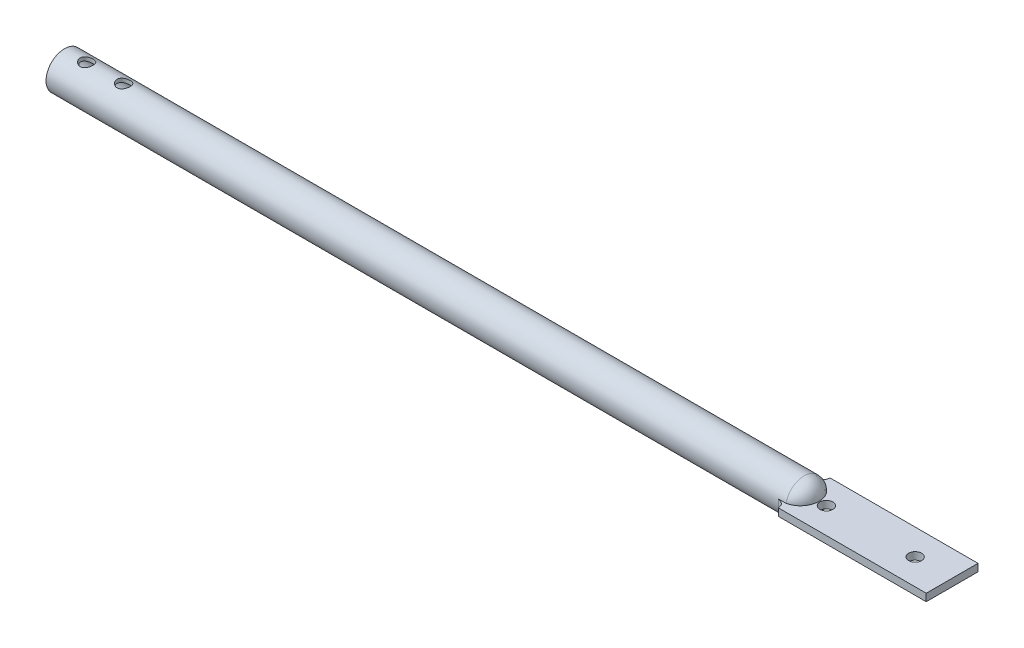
ISO-10303-21;
HEADER;
FILE_DESCRIPTION(('STEP AP214'),'2;1');
FILE_NAME('part.step','',(''),(''),'','','');
FILE_SCHEMA(('AUTOMOTIVE_DESIGN { 1 0 10303 214 1 1 1 1 }'));
ENDSEC;
DATA;
#1=APPLICATION_CONTEXT('core data for automotive mechanical design processes');
#2=APPLICATION_PROTOCOL_DEFINITION('international standard','automotive_design',2000,#1);
#3=PRODUCT_CONTEXT('',#1,'mechanical');
#4=PRODUCT('Part','Part','',(#3));
#5=PRODUCT_RELATED_PRODUCT_CATEGORY('part','',(#4));
#6=PRODUCT_DEFINITION_FORMATION('','',#4);
#7=PRODUCT_DEFINITION_CONTEXT('part definition',#1,'design');
#8=PRODUCT_DEFINITION('design','',#6,#7);
#9=PRODUCT_DEFINITION_SHAPE('','',#8);
#10=(LENGTH_UNIT() NAMED_UNIT(*) SI_UNIT(.MILLI.,.METRE.));
#11=(NAMED_UNIT(*) PLANE_ANGLE_UNIT() SI_UNIT($,.RADIAN.));
#12=(NAMED_UNIT(*) SI_UNIT($,.STERADIAN.) SOLID_ANGLE_UNIT());
#13=UNCERTAINTY_MEASURE_WITH_UNIT(LENGTH_MEASURE(1.E-05),#10,'distance_accuracy_value','');
#14=(GEOMETRIC_REPRESENTATION_CONTEXT(3) GLOBAL_UNCERTAINTY_ASSIGNED_CONTEXT((#13)) GLOBAL_UNIT_ASSIGNED_CONTEXT((#10,
#11,#12)) REPRESENTATION_CONTEXT('',''));
#15=CARTESIAN_POINT('',(0.,0.,0.));
#16=DIRECTION('',(0.,0.,1.));
#17=DIRECTION('',(1.,0.,0.));
#18=AXIS2_PLACEMENT_3D('',#15,#16,#17);
#19=CARTESIAN_POINT('',(200.,-1.,7.));
#20=DIRECTION('',(0.,1.,0.));
#21=DIRECTION('',(0.,0.,1.));
#22=AXIS2_PLACEMENT_3D('',#19,#20,#21);
#23=PLANE('',#22);
#24=CARTESIAN_POINT('',(199.,-1.,0.));
#25=DIRECTION('',(0.,-1.,0.));
#26=DIRECTION('',(0.,0.,-1.));
#27=AXIS2_PLACEMENT_3D('',#24,#25,#26);
#28=CIRCLE('',#27,4.00000000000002);
#29=CARTESIAN_POINT('',(200.,-1.,-3.87298334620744));
#30=VERTEX_POINT('',#29);
#31=CARTESIAN_POINT('',(200.,-1.,3.87298334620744));
#32=VERTEX_POINT('',#31);
#33=EDGE_CURVE('E148',#30,#32,#28,.T.);
#34=ORIENTED_EDGE('',*,*,#33,.T.);
#35=DIRECTION('',(0.,0.,-1.));
#36=VECTOR('',#35,1.);
#37=CARTESIAN_POINT('',(200.,-1.,7.));
#38=LINE('',#37,#36);
#39=EDGE_CURVE('E313',#32,#30,#38,.T.);
#40=ORIENTED_EDGE('',*,*,#39,.T.);
#41=EDGE_LOOP('',(#34,#40));
#42=FACE_BOUND('',#41,.T.);
#43=ADVANCED_FACE('F33',(#42),#23,.F.);
#44=CARTESIAN_POINT('',(206.,-1.,0.));
#45=DIRECTION('',(0.,-1.,0.));
#46=DIRECTION('',(0.,0.,-1.));
#47=AXIS2_PLACEMENT_3D('',#44,#45,#46);
#48=CIRCLE('',#47,1.75000000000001);
#49=CARTESIAN_POINT('',(206.,-1.,-1.75000000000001));
#50=VERTEX_POINT('',#49);
#51=EDGE_CURVE('E345',#50,#50,#48,.T.);
#52=ORIENTED_EDGE('',*,*,#51,.F.);
#53=EDGE_LOOP('',(#52));
#54=FACE_BOUND('',#53,.T.);
#55=CARTESIAN_POINT('',(230.,-1.,0.));
#56=DIRECTION('',(0.,-1.,0.));
#57=DIRECTION('',(0.,0.,-1.));
#58=AXIS2_PLACEMENT_3D('',#55,#56,#57);
#59=CIRCLE('',#58,1.75000000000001);
#60=CARTESIAN_POINT('',(230.,-1.,-1.75000000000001));
#61=VERTEX_POINT('',#60);
#62=EDGE_CURVE('E342',#61,#61,#59,.T.);
#63=ORIENTED_EDGE('',*,*,#62,.F.);
#64=EDGE_LOOP('',(#63));
#65=FACE_BOUND('',#64,.T.);
#66=CARTESIAN_POINT('',(199.,-1.,0.));
#67=DIRECTION('',(0.,1.,0.));
#68=DIRECTION('',(0.,0.,-1.));
#69=AXIS2_PLACEMENT_3D('',#66,#67,#68);
#70=CIRCLE('',#69,5.);
#71=CARTESIAN_POINT('',(200.,-1.,4.89897948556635));
#72=VERTEX_POINT('',#71);
#73=CARTESIAN_POINT('',(200.,-1.,-4.89897948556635));
#74=VERTEX_POINT('',#73);
#75=EDGE_CURVE('E139',#72,#74,#70,.T.);
#76=ORIENTED_EDGE('',*,*,#75,.T.);
#77=DIRECTION('',(-1.,0.,0.));
#78=VECTOR('',#77,1.);
#79=CARTESIAN_POINT('',(0.,-1.,-4.89897948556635));
#80=LINE('',#79,#78);
#81=CARTESIAN_POINT('',(198.,-1.,-4.89897948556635));
#82=VERTEX_POINT('',#81);
#83=EDGE_CURVE('E130',#74,#82,#80,.T.);
#84=ORIENTED_EDGE('',*,*,#83,.T.);
#85=DIRECTION('',(0.,0.,-1.));
#86=VECTOR('',#85,1.);
#87=CARTESIAN_POINT('',(198.,-1.,-5.));
#88=LINE('',#87,#86);
#89=CARTESIAN_POINT('',(198.,-1.,-5.));
#90=VERTEX_POINT('',#89);
#91=EDGE_CURVE('E160',#82,#90,#88,.T.);
#92=ORIENTED_EDGE('',*,*,#91,.T.);
#93=CARTESIAN_POINT('',(198.,-1.,-6.99999999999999));
#94=DIRECTION('',(0.,1.,0.));
#95=DIRECTION('',(0.,0.,-1.));
#96=AXIS2_PLACEMENT_3D('',#93,#94,#95);
#97=CIRCLE('',#96,2.);
#98=CARTESIAN_POINT('',(200.,-1.,-7.));
#99=VERTEX_POINT('',#98);
#100=EDGE_CURVE('E155',#90,#99,#97,.T.);
#101=ORIENTED_EDGE('',*,*,#100,.T.);
#102=DIRECTION('',(1.,0.,0.));
#103=VECTOR('',#102,1.);
#104=CARTESIAN_POINT('',(200.,-1.,-7.));
#105=LINE('',#104,#103);
#106=CARTESIAN_POINT('',(240.,-1.,-7.));
#107=VERTEX_POINT('',#106);
#108=EDGE_CURVE('E366',#99,#107,#105,.T.);
#109=ORIENTED_EDGE('',*,*,#108,.T.);
#110=DIRECTION('',(0.,0.,-1.));
#111=VECTOR('',#110,1.);
#112=CARTESIAN_POINT('',(240.,-1.,7.));
#113=LINE('',#112,#111);
#114=CARTESIAN_POINT('',(240.,-1.,7.));
#115=VERTEX_POINT('',#114);
#116=EDGE_CURVE('E326',#115,#107,#113,.T.);
#117=ORIENTED_EDGE('',*,*,#116,.F.);
#118=DIRECTION('',(1.,0.,0.));
#119=VECTOR('',#118,1.);
#120=CARTESIAN_POINT('',(200.,-1.,7.));
#121=LINE('',#120,#119);
#122=CARTESIAN_POINT('',(200.,-1.,7.));
#123=VERTEX_POINT('',#122);
#124=EDGE_CURVE('E356',#123,#115,#121,.T.);
#125=ORIENTED_EDGE('',*,*,#124,.F.);
#126=CARTESIAN_POINT('',(198.,-1.,6.99999999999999));
#127=DIRECTION('',(0.,-1.,0.));
#128=DIRECTION('',(0.,0.,1.));
#129=AXIS2_PLACEMENT_3D('',#126,#127,#128);
#130=CIRCLE('',#129,2.);
#131=CARTESIAN_POINT('',(198.,-1.,5.));
#132=VERTEX_POINT('',#131);
#133=EDGE_CURVE('E175',#132,#123,#130,.T.);
#134=ORIENTED_EDGE('',*,*,#133,.F.);
#135=DIRECTION('',(0.,0.,1.));
#136=VECTOR('',#135,1.);
#137=CARTESIAN_POINT('',(198.,-1.,5.));
#138=LINE('',#137,#136);
#139=CARTESIAN_POINT('',(198.,-1.,4.89897948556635));
#140=VERTEX_POINT('',#139);
#141=EDGE_CURVE('E142',#140,#132,#138,.T.);
#142=ORIENTED_EDGE('',*,*,#141,.F.);
#143=DIRECTION('',(-1.,0.,0.));
#144=VECTOR('',#143,1.);
#145=CARTESIAN_POINT('',(0.,-1.,4.89897948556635));
#146=LINE('',#145,#144);
#147=EDGE_CURVE('E128',#140,#72,#146,.F.);
#148=ORIENTED_EDGE('',*,*,#147,.T.);
#149=EDGE_LOOP('',(#76,#84,#92,#101,#109,#117,#125,#134,#142,#148));
#150=FACE_BOUND('',#149,.T.);
#151=ADVANCED_FACE('F138',(#54,#65,#150),#23,.F.);
#152=CARTESIAN_POINT('',(200.,1.,7.));
#153=DIRECTION('',(0.,-1.,0.));
#154=DIRECTION('',(0.,0.,-1.));
#155=AXIS2_PLACEMENT_3D('',#152,#153,#154);
#156=PLANE('',#155);
#157=CARTESIAN_POINT('',(206.,1.,0.));
#158=DIRECTION('',(0.,-1.,0.));
#159=DIRECTION('',(0.,0.,-1.));
#160=AXIS2_PLACEMENT_3D('',#157,#158,#159);
#161=CIRCLE('',#160,1.75000000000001);
#162=CARTESIAN_POINT('',(206.,1.,-1.75000000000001));
#163=VERTEX_POINT('',#162);
#164=EDGE_CURVE('E343',#163,#163,#161,.T.);
#165=ORIENTED_EDGE('',*,*,#164,.T.);
#166=EDGE_LOOP('',(#165));
#167=FACE_BOUND('',#166,.T.);
#168=CARTESIAN_POINT('',(230.,1.,0.));
#169=DIRECTION('',(0.,-1.,0.));
#170=DIRECTION('',(0.,0.,-1.));
#171=AXIS2_PLACEMENT_3D('',#168,#169,#170);
#172=CIRCLE('',#171,1.75000000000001);
#173=CARTESIAN_POINT('',(230.,1.,-1.75000000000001));
#174=VERTEX_POINT('',#173);
#175=EDGE_CURVE('E339',#174,#174,#172,.T.);
#176=ORIENTED_EDGE('',*,*,#175,.T.);
#177=EDGE_LOOP('',(#176));
#178=FACE_BOUND('',#177,.T.);
#179=CARTESIAN_POINT('',(199.,1.,0.));
#180=DIRECTION('',(0.,-1.,0.));
#181=DIRECTION('',(0.,0.,-1.));
#182=AXIS2_PLACEMENT_3D('',#179,#180,#181);
#183=CIRCLE('',#182,5.);
#184=CARTESIAN_POINT('',(200.,1.,-4.89897948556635));
#185=VERTEX_POINT('',#184);
#186=CARTESIAN_POINT('',(200.,1.,4.89897948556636));
#187=VERTEX_POINT('',#186);
#188=EDGE_CURVE('E147',#185,#187,#183,.T.);
#189=ORIENTED_EDGE('',*,*,#188,.T.);
#190=DIRECTION('',(-1.,0.,0.));
#191=VECTOR('',#190,1.);
#192=CARTESIAN_POINT('',(0.,1.,4.89897948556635));
#193=LINE('',#192,#191);
#194=CARTESIAN_POINT('',(198.,1.,4.89897948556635));
#195=VERTEX_POINT('',#194);
#196=EDGE_CURVE('E143',#195,#187,#193,.F.);
#197=ORIENTED_EDGE('',*,*,#196,.F.);
#198=DIRECTION('',(0.,0.,1.));
#199=VECTOR('',#198,1.);
#200=CARTESIAN_POINT('',(198.,1.,5.));
#201=LINE('',#200,#199);
#202=CARTESIAN_POINT('',(198.,1.,5.));
#203=VERTEX_POINT('',#202);
#204=EDGE_CURVE('E172',#195,#203,#201,.T.);
#205=ORIENTED_EDGE('',*,*,#204,.T.);
#206=CARTESIAN_POINT('',(198.,1.,6.99999999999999));
#207=DIRECTION('',(0.,-1.,0.));
#208=DIRECTION('',(0.,0.,1.));
#209=AXIS2_PLACEMENT_3D('',#206,#207,#208);
#210=CIRCLE('',#209,2.);
#211=CARTESIAN_POINT('',(200.,1.,7.));
#212=VERTEX_POINT('',#211);
#213=EDGE_CURVE('E174',#203,#212,#210,.T.);
#214=ORIENTED_EDGE('',*,*,#213,.T.);
#215=DIRECTION('',(-1.,0.,0.));
#216=VECTOR('',#215,1.);
#217=CARTESIAN_POINT('',(200.,1.,7.));
#218=LINE('',#217,#216);
#219=CARTESIAN_POINT('',(240.,1.,7.));
#220=VERTEX_POINT('',#219);
#221=EDGE_CURVE('E361',#220,#212,#218,.T.);
#222=ORIENTED_EDGE('',*,*,#221,.F.);
#223=DIRECTION('',(0.,0.,-1.));
#224=VECTOR('',#223,1.);
#225=CARTESIAN_POINT('',(240.,1.,7.));
#226=LINE('',#225,#224);
#227=CARTESIAN_POINT('',(240.,1.,-7.));
#228=VERTEX_POINT('',#227);
#229=EDGE_CURVE('E372',#220,#228,#226,.T.);
#230=ORIENTED_EDGE('',*,*,#229,.T.);
#231=DIRECTION('',(-1.,0.,0.));
#232=VECTOR('',#231,1.);
#233=CARTESIAN_POINT('',(200.,1.,-7.));
#234=LINE('',#233,#232);
#235=CARTESIAN_POINT('',(200.,1.,-7.));
#236=VERTEX_POINT('',#235);
#237=EDGE_CURVE('E357',#228,#236,#234,.T.);
#238=ORIENTED_EDGE('',*,*,#237,.T.);
#239=CARTESIAN_POINT('',(198.,1.,-6.99999999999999));
#240=DIRECTION('',(0.,1.,0.));
#241=DIRECTION('',(0.,0.,-1.));
#242=AXIS2_PLACEMENT_3D('',#239,#240,#241);
#243=CIRCLE('',#242,2.);
#244=CARTESIAN_POINT('',(198.,1.,-5.));
#245=VERTEX_POINT('',#244);
#246=EDGE_CURVE('E156',#245,#236,#243,.T.);
#247=ORIENTED_EDGE('',*,*,#246,.F.);
#248=DIRECTION('',(0.,0.,-1.));
#249=VECTOR('',#248,1.);
#250=CARTESIAN_POINT('',(198.,1.,-5.));
#251=LINE('',#250,#249);
#252=CARTESIAN_POINT('',(198.,1.,-4.89897948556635));
#253=VERTEX_POINT('',#252);
#254=EDGE_CURVE('E159',#253,#245,#251,.T.);
#255=ORIENTED_EDGE('',*,*,#254,.F.);
#256=DIRECTION('',(-1.,0.,0.));
#257=VECTOR('',#256,1.);
#258=CARTESIAN_POINT('',(0.,1.,-4.89897948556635));
#259=LINE('',#258,#257);
#260=EDGE_CURVE('E47',#185,#253,#259,.T.);
#261=ORIENTED_EDGE('',*,*,#260,.F.);
#262=EDGE_LOOP('',(#189,#197,#205,#214,#222,#230,#238,#247,#255,#261));
#263=FACE_BOUND('',#262,.T.);
#264=ADVANCED_FACE('F297',(#167,#178,#263),#156,.F.);
#265=CARTESIAN_POINT('',(199.,1.,0.));
#266=DIRECTION('',(0.,1.,0.));
#267=DIRECTION('',(0.,0.,-1.));
#268=AXIS2_PLACEMENT_3D('',#265,#266,#267);
#269=CIRCLE('',#268,4.00000000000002);
#270=CARTESIAN_POINT('',(200.,1.,3.87298334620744));
#271=VERTEX_POINT('',#270);
#272=CARTESIAN_POINT('',(200.,1.,-3.87298334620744));
#273=VERTEX_POINT('',#272);
#274=EDGE_CURVE('E150',#271,#273,#269,.T.);
#275=ORIENTED_EDGE('',*,*,#274,.T.);
#276=DIRECTION('',(0.,0.,-1.));
#277=VECTOR('',#276,1.);
#278=CARTESIAN_POINT('',(200.,1.,7.));
#279=LINE('',#278,#277);
#280=EDGE_CURVE('E363',#271,#273,#279,.T.);
#281=ORIENTED_EDGE('',*,*,#280,.F.);
#282=EDGE_LOOP('',(#275,#281));
#283=FACE_BOUND('',#282,.T.);
#284=ADVANCED_FACE('F300',(#283),#156,.F.);
#285=CARTESIAN_POINT('',(0.,4.,0.));
#286=DIRECTION('',(1.,0.,0.));
#287=DIRECTION('',(0.,0.,-1.));
#288=AXIS2_PLACEMENT_3D('',#285,#286,#287);
#289=PLANE('',#288);
#290=CARTESIAN_POINT('',(0.,0.,0.));
#291=DIRECTION('',(-1.,0.,0.));
#292=DIRECTION('',(0.,0.,1.));
#293=AXIS2_PLACEMENT_3D('',#290,#291,#292);
#294=CIRCLE('',#293,4.);
#295=CARTESIAN_POINT('',(0.,0.,4.));
#296=VERTEX_POINT('',#295);
#297=EDGE_CURVE('E325',#296,#296,#294,.T.);
#298=ORIENTED_EDGE('',*,*,#297,.F.);
#299=EDGE_LOOP('',(#298));
#300=FACE_BOUND('',#299,.T.);
#301=CARTESIAN_POINT('',(0.,0.,0.));
#302=DIRECTION('',(-1.,0.,0.));
#303=DIRECTION('',(0.,0.,1.));
#304=AXIS2_PLACEMENT_3D('',#301,#302,#303);
#305=CIRCLE('',#304,5.);
#306=CARTESIAN_POINT('',(0.,0.,5.));
#307=VERTEX_POINT('',#306);
#308=EDGE_CURVE('E336',#307,#307,#305,.T.);
#309=ORIENTED_EDGE('',*,*,#308,.T.);
#310=EDGE_LOOP('',(#309));
#311=FACE_BOUND('',#310,.T.);
#312=ADVANCED_FACE('F35',(#300,#311),#289,.F.);
#313=CARTESIAN_POINT('',(0.,0.,0.));
#314=DIRECTION('',(-1.,0.,0.));
#315=DIRECTION('',(0.,0.,1.));
#316=AXIS2_PLACEMENT_3D('',#313,#314,#315);
#317=CYLINDRICAL_SURFACE('',#316,5.);
#318=CARTESIAN_POINT('',(194.,-4.17582327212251,2.75000000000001));
#319=CARTESIAN_POINT('',(194.070501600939,-4.17582282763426,2.75000021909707));
#320=CARTESIAN_POINT('',(194.140996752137,-4.17761648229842,2.74728376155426));
#321=CARTESIAN_POINT('',(194.281403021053,-4.18470505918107,2.73647210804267));
#322=CARTESIAN_POINT('',(194.35131394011,-4.19000112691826,2.72837515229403));
#323=CARTESIAN_POINT('',(194.559478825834,-4.21088387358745,2.69613793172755));
#324=CARTESIAN_POINT('',(194.696096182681,-4.23146480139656,2.66405146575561));
#325=CARTESIAN_POINT('',(194.960128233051,-4.28282202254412,2.58065258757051));
#326=CARTESIAN_POINT('',(195.087594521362,-4.31353460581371,2.52946006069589));
#327=CARTESIAN_POINT('',(195.332109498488,-4.38157709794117,2.40967270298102));
#328=CARTESIAN_POINT('',(195.449156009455,-4.4189083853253,2.34107424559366));
#329=CARTESIAN_POINT('',(195.682490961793,-4.50057018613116,2.18031648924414));
#330=CARTESIAN_POINT('',(195.797507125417,-4.54522676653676,2.08647663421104));
#331=CARTESIAN_POINT('',(196.011191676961,-4.63389010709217,1.88137082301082));
#332=CARTESIAN_POINT('',(196.109850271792,-4.67789646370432,1.77009450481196));
#333=CARTESIAN_POINT('',(196.296354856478,-4.76480423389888,1.52164006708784));
#334=CARTESIAN_POINT('',(196.382545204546,-4.80728637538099,1.38305834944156));
#335=CARTESIAN_POINT('',(196.52979645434,-4.881939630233,1.09058259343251));
#336=CARTESIAN_POINT('',(196.590876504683,-4.91411859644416,0.936700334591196));
#337=CARTESIAN_POINT('',(196.680823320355,-4.96215637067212,0.631538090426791));
#338=CARTESIAN_POINT('',(196.711946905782,-4.9791500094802,0.481106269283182));
#339=CARTESIAN_POINT('',(196.748624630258,-4.99921867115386,0.17628141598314));
#340=CARTESIAN_POINT('',(196.754198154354,-5.0023042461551,0.0218914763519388));
#341=CARTESIAN_POINT('',(196.74026645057,-4.99465210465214,-0.269094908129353));
#342=CARTESIAN_POINT('',(196.723326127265,-4.98532800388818,-0.405861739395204));
#343=CARTESIAN_POINT('',(196.669573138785,-4.9561689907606,-0.674248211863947));
#344=CARTESIAN_POINT('',(196.632758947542,-4.93633327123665,-0.805867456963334));
#345=CARTESIAN_POINT('',(196.540303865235,-4.88764651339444,-1.06213243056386));
#346=CARTESIAN_POINT('',(196.484464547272,-4.85870071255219,-1.18668782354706));
#347=CARTESIAN_POINT('',(196.355948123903,-4.79425711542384,-1.42490272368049));
#348=CARTESIAN_POINT('',(196.283265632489,-4.75875722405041,-1.53855872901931));
#349=CARTESIAN_POINT('',(196.114189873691,-4.67986322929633,-1.76486269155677));
#350=CARTESIAN_POINT('',(196.016084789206,-4.6360306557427,-1.87607984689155));
#351=CARTESIAN_POINT('',(195.803468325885,-4.54759531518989,-2.08132006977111));
#352=CARTESIAN_POINT('',(195.688940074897,-4.50299179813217,-2.17532522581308));
#353=CARTESIAN_POINT('',(195.434468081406,-4.41359884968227,-2.3517577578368));
#354=CARTESIAN_POINT('',(195.293175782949,-4.36913687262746,-2.43244416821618));
#355=CARTESIAN_POINT('',(195.070631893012,-4.31029251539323,-2.53434870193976));
#356=CARTESIAN_POINT('',(194.994668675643,-4.29198329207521,-2.56513311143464));
#357=CARTESIAN_POINT('',(194.839655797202,-4.25873283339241,-2.61996609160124));
#358=CARTESIAN_POINT('',(194.760608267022,-4.24378931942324,-2.64401922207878));
#359=CARTESIAN_POINT('',(194.606486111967,-4.21900613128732,-2.68337195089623));
#360=CARTESIAN_POINT('',(194.531601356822,-4.20885322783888,-2.69921890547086));
#361=CARTESIAN_POINT('',(194.38039026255,-4.19244004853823,-2.72464238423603));
#362=CARTESIAN_POINT('',(194.304064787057,-4.18617751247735,-2.73422254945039));
#363=CARTESIAN_POINT('',(194.150699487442,-4.17784129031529,-2.74694424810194));
#364=CARTESIAN_POINT('',(194.073660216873,-4.17576459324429,-2.75009040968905));
#365=CARTESIAN_POINT('',(193.91961908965,-4.17588465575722,-2.74990548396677));
#366=CARTESIAN_POINT('',(193.842617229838,-4.17808095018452,-2.74657510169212));
#367=CARTESIAN_POINT('',(193.635128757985,-4.18970823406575,-2.72884011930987));
#368=CARTESIAN_POINT('',(193.50533131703,-4.2031573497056,-2.70826917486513));
#369=CARTESIAN_POINT('',(193.251482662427,-4.24050959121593,-2.64938782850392));
#370=CARTESIAN_POINT('',(193.127433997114,-4.26441730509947,-2.6110696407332));
#371=CARTESIAN_POINT('',(192.882393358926,-4.32107988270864,-2.51623395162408));
#372=CARTESIAN_POINT('',(192.761750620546,-4.35416518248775,-2.45901741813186));
#373=CARTESIAN_POINT('',(192.531062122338,-4.42529168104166,-2.32858502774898));
#374=CARTESIAN_POINT('',(192.421021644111,-4.46333532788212,-2.25536125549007));
#375=CARTESIAN_POINT('',(192.196374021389,-4.54731256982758,-2.08150633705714));
#376=CARTESIAN_POINT('',(192.083805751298,-4.59354122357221,-1.97837091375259));
#377=CARTESIAN_POINT('',(191.876758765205,-4.68369107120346,-1.75431725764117));
#378=CARTESIAN_POINT('',(191.782290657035,-4.72761090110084,-1.63338866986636));
#379=CARTESIAN_POINT('',(191.609694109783,-4.81093144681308,-1.3693190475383));
#380=CARTESIAN_POINT('',(191.532633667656,-4.84999127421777,-1.22536393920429));
#381=CARTESIAN_POINT('',(191.40464281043,-4.9163370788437,-0.923782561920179));
#382=CARTESIAN_POINT('',(191.353685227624,-4.94363529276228,-0.766170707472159));
#383=CARTESIAN_POINT('',(191.284489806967,-4.98103875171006,-0.459029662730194));
#384=CARTESIAN_POINT('',(191.263448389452,-4.99261175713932,-0.310311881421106));
#385=CARTESIAN_POINT('',(191.245946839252,-5.00222394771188,-0.0110279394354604));
#386=CARTESIAN_POINT('',(191.249473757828,-5.00027026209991,0.139537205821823));
#387=CARTESIAN_POINT('',(191.279449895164,-4.98385070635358,0.423930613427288));
#388=CARTESIAN_POINT('',(191.303822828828,-4.97051840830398,0.558052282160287));
#389=CARTESIAN_POINT('',(191.371607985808,-4.9340783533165,0.81997637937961));
#390=CARTESIAN_POINT('',(191.415022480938,-4.91096942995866,0.947778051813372));
#391=CARTESIAN_POINT('',(191.521021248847,-4.85599790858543,1.19846717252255));
#392=CARTESIAN_POINT('',(191.584210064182,-4.82386308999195,1.32103731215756));
#393=CARTESIAN_POINT('',(191.727208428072,-4.75386088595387,1.55423719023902));
#394=CARTESIAN_POINT('',(191.807024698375,-4.71599118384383,1.66486207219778));
#395=CARTESIAN_POINT('',(191.991546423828,-4.63290844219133,1.88453747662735));
#396=CARTESIAN_POINT('',(192.098058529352,-4.58735173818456,1.99194408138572));
#397=CARTESIAN_POINT('',(192.327499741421,-4.49706533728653,2.18817152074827));
#398=CARTESIAN_POINT('',(192.450448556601,-4.45233670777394,2.27696970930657));
#399=CARTESIAN_POINT('',(192.71958857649,-4.3657490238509,2.43910932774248));
#400=CARTESIAN_POINT('',(192.86678093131,-4.32427762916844,2.51103318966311));
#401=CARTESIAN_POINT('',(193.097023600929,-4.27168258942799,2.59882409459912));
#402=CARTESIAN_POINT('',(193.17527878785,-4.25576204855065,2.62472554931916));
#403=CARTESIAN_POINT('',(193.33442805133,-4.22780876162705,2.66951909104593));
#404=CARTESIAN_POINT('',(193.415320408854,-4.21577353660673,2.68841564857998));
#405=CARTESIAN_POINT('',(193.579653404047,-4.19612739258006,2.71897954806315));
#406=CARTESIAN_POINT('',(193.663108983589,-4.18855166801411,2.73058942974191));
#407=CARTESIAN_POINT('',(193.831046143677,-4.17839992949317,2.74609943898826));
#408=CARTESIAN_POINT('',(193.915527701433,-4.17582380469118,2.74999973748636));
#409=CARTESIAN_POINT('',(194.,-4.17582327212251,2.75000000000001));
#410=B_SPLINE_CURVE_WITH_KNOTS('',3,(#318,#319,#320,#321,#322,#323,#324,#325,#326,#327,#328,
#329,#330,#331,#332,#333,#334,#335,#336,#337,#338,#339,#340,#341,#342,#343,#344,#345,#346,#347,
#348,#349,#350,#351,#352,#353,#354,#355,#356,#357,#358,#359,#360,#361,#362,#363,#364,#365,#366,
#367,#368,#369,#370,#371,#372,#373,#374,#375,#376,#377,#378,#379,#380,#381,#382,#383,#384,#385,
#386,#387,#388,#389,#390,#391,#392,#393,#394,#395,#396,#397,#398,#399,#400,#401,#402,#403,#404,
#405,#406,#407,#408,#409),.UNSPECIFIED.,.T.,.F.,(4,2,2,2,2,2,2,2,2,2,2,2,2,2,2,2,2,2,2,2,2,2,2,
2,2,2,2,2,2,2,2,2,2,2,2,2,2,2,2,2,2,2,2,2,2,4),(0.,0.211411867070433,0.422892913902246,
0.846058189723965,1.26661167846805,1.68725286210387,2.15040846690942,2.61384036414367,
3.11706196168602,3.61989909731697,4.08091191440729,4.541574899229,4.95400152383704,
5.36645982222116,5.78335877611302,6.20039122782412,6.66240193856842,7.12489073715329,
7.62798219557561,7.87961678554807,8.13108050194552,8.36237509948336,8.59353519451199,
8.82452895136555,9.05549756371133,9.44981762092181,9.84431083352,10.2554321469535,
10.6667572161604,11.1432532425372,11.6200276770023,12.1209146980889,12.6212793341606,
13.0706890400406,13.5198619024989,13.9289007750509,14.3379884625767,14.7610597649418,
15.1843024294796,15.6562156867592,16.1286999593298,16.6325525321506,16.8840665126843,
17.135419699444,17.3887308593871,17.6420364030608),.UNSPECIFIED.);
#411=CARTESIAN_POINT('',(194.,-4.17582327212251,2.75000000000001));
#412=VERTEX_POINT('',#411);
#413=EDGE_CURVE('E186',#412,#412,#410,.T.);
#414=ORIENTED_EDGE('',*,*,#413,.T.);
#415=EDGE_LOOP('',(#414));
#416=FACE_BOUND('',#415,.T.);
#417=CARTESIAN_POINT('',(16.,-4.6837484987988,1.75));
#418=CARTESIAN_POINT('',(16.0950076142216,-4.68374720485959,1.75000152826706));
#419=CARTESIAN_POINT('',(16.1900045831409,-4.68667080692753,1.74223702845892));
#420=CARTESIAN_POINT('',(16.377164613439,-4.6979805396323,1.71150284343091));
#421=CARTESIAN_POINT('',(16.4693274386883,-4.70636712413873,1.68853189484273));
#422=CARTESIAN_POINT('',(16.6480733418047,-4.72753898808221,1.6283062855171));
#423=CARTESIAN_POINT('',(16.7346678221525,-4.74031491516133,1.59108197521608));
#424=CARTESIAN_POINT('',(16.9004133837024,-4.76881178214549,1.50351160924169));
#425=CARTESIAN_POINT('',(16.9795625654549,-4.78453347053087,1.45316221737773));
#426=CARTESIAN_POINT('',(17.1315893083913,-4.81791171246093,1.33844146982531));
#427=CARTESIAN_POINT('',(17.2040989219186,-4.83561998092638,1.27359743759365));
#428=CARTESIAN_POINT('',(17.3374687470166,-4.87054126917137,1.13273458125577));
#429=CARTESIAN_POINT('',(17.3983268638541,-4.88775419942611,1.0567137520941));
#430=CARTESIAN_POINT('',(17.50837506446,-4.92035027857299,0.892925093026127));
#431=CARTESIAN_POINT('',(17.5571740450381,-4.93566559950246,0.804879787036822));
#432=CARTESIAN_POINT('',(17.6391198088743,-4.96212680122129,0.621200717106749));
#433=CARTESIAN_POINT('',(17.6722712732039,-4.9732739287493,0.525569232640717));
#434=CARTESIAN_POINT('',(17.7207167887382,-4.98977617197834,0.333294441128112));
#435=CARTESIAN_POINT('',(17.736642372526,-4.99533555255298,0.236828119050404));
#436=CARTESIAN_POINT('',(17.7521980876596,-5.00076407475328,0.0424428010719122));
#437=CARTESIAN_POINT('',(17.7518328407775,-5.00063483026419,-0.0554757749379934));
#438=CARTESIAN_POINT('',(17.7352051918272,-4.99483582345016,-0.245494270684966));
#439=CARTESIAN_POINT('',(17.7196299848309,-4.98940556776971,-0.33766285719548));
#440=CARTESIAN_POINT('',(17.6741684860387,-4.97392058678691,-0.517984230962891));
#441=CARTESIAN_POINT('',(17.6442812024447,-4.96386554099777,-0.606136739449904));
#442=CARTESIAN_POINT('',(17.5706753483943,-4.9399693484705,-0.777357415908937));
#443=CARTESIAN_POINT('',(17.5267718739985,-4.92607794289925,-0.860338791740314));
#444=CARTESIAN_POINT('',(17.426536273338,-4.89593962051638,-1.01795058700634));
#445=CARTESIAN_POINT('',(17.3702004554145,-4.87969200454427,-1.09257851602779));
#446=CARTESIAN_POINT('',(17.2432939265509,-4.84555061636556,-1.23543995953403));
#447=CARTESIAN_POINT('',(17.1721389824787,-4.82761516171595,-1.30314530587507));
#448=CARTESIAN_POINT('',(17.0193480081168,-4.79281181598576,-1.42584439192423));
#449=CARTESIAN_POINT('',(16.9377100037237,-4.77594412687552,-1.48083573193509));
#450=CARTESIAN_POINT('',(16.7644399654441,-4.74494411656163,-1.57738076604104));
#451=CARTESIAN_POINT('',(16.6726606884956,-4.7308636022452,-1.61868813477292));
#452=CARTESIAN_POINT('',(16.4828293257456,-4.70762977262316,-1.68507378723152));
#453=CARTESIAN_POINT('',(16.3847802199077,-4.69847413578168,-1.71015971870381));
#454=CARTESIAN_POINT('',(16.190351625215,-4.68666052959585,-1.74226665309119));
#455=CARTESIAN_POINT('',(16.0941268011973,-4.68370541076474,-1.75011468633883));
#456=CARTESIAN_POINT('',(15.9017104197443,-4.68379251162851,-1.74988283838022));
#457=CARTESIAN_POINT('',(15.805518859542,-4.68683349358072,-1.74180624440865));
#458=CARTESIAN_POINT('',(15.6198409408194,-4.69827167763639,-1.71070041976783));
#459=CARTESIAN_POINT('',(15.530239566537,-4.70645413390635,-1.68827004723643));
#460=CARTESIAN_POINT('',(15.3560984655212,-4.72700986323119,-1.62982534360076));
#461=CARTESIAN_POINT('',(15.2715596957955,-4.73938392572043,-1.59380845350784));
#462=CARTESIAN_POINT('',(15.1067452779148,-4.76744975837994,-1.50782257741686));
#463=CARTESIAN_POINT('',(15.0267132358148,-4.78324025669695,-1.45741978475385));
#464=CARTESIAN_POINT('',(14.875945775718,-4.81617843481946,-1.34457250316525));
#465=CARTESIAN_POINT('',(14.805213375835,-4.83332655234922,-1.28212412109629));
#466=CARTESIAN_POINT('',(14.6711063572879,-4.8681655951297,-1.14296623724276));
#467=CARTESIAN_POINT('',(14.6083339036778,-4.8858359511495,-1.06566944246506));
#468=CARTESIAN_POINT('',(14.4965990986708,-4.91882686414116,-0.901202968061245));
#469=CARTESIAN_POINT('',(14.4476364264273,-4.93414747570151,-0.814033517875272));
#470=CARTESIAN_POINT('',(14.3653228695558,-4.96066068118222,-0.632608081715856));
#471=CARTESIAN_POINT('',(14.331885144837,-4.97187616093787,-0.538395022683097));
#472=CARTESIAN_POINT('',(14.2814872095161,-4.98900968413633,-0.345207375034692));
#473=CARTESIAN_POINT('',(14.2645203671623,-4.99492985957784,-0.24623471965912));
#474=CARTESIAN_POINT('',(14.2481897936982,-5.00062864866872,-0.0518184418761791));
#475=CARTESIAN_POINT('',(14.2479654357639,-5.00070752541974,0.0435448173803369));
#476=CARTESIAN_POINT('',(14.2629680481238,-4.99547100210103,0.232887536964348));
#477=CARTESIAN_POINT('',(14.278193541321,-4.99015611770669,0.326867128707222));
#478=CARTESIAN_POINT('',(14.3230773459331,-4.97485061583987,0.508981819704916));
#479=CARTESIAN_POINT('',(14.3524559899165,-4.9649507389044,0.597194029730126));
#480=CARTESIAN_POINT('',(14.4245463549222,-4.9414973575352,0.767462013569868));
#481=CARTESIAN_POINT('',(14.4672605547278,-4.92794317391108,0.849516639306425));
#482=CARTESIAN_POINT('',(14.5667271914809,-4.89790160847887,1.00865029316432));
#483=CARTESIAN_POINT('',(14.623963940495,-4.88132013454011,1.08540856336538));
#484=CARTESIAN_POINT('',(14.7500513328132,-4.84728694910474,1.22850678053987));
#485=CARTESIAN_POINT('',(14.8189058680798,-4.82983494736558,1.29484322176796));
#486=CARTESIAN_POINT('',(14.9699185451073,-4.79509560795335,1.41822148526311));
#487=CARTESIAN_POINT('',(15.0525313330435,-4.77784991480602,1.4747204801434));
#488=CARTESIAN_POINT('',(15.2266238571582,-4.74639844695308,1.57301525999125));
#489=CARTESIAN_POINT('',(15.3181024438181,-4.73219227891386,1.61481294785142));
#490=CARTESIAN_POINT('',(15.506402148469,-4.70877102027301,1.68188417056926));
#491=CARTESIAN_POINT('',(15.6031528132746,-4.69950235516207,1.70733571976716));
#492=CARTESIAN_POINT('',(15.7999405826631,-4.68699312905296,1.74138904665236));
#493=CARTESIAN_POINT('',(15.8999761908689,-4.68374986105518,1.74999839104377));
#494=CARTESIAN_POINT('',(16.,-4.6837484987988,1.75));
#495=B_SPLINE_CURVE_WITH_KNOTS('',3,(#417,#418,#419,#420,#421,#422,#423,#424,#425,#426,#427,
#428,#429,#430,#431,#432,#433,#434,#435,#436,#437,#438,#439,#440,#441,#442,#443,#444,#445,#446,
#447,#448,#449,#450,#451,#452,#453,#454,#455,#456,#457,#458,#459,#460,#461,#462,#463,#464,#465,
#466,#467,#468,#469,#470,#471,#472,#473,#474,#475,#476,#477,#478,#479,#480,#481,#482,#483,#484,
#485,#486,#487,#488,#489,#490,#491,#492,#493,#494),.UNSPECIFIED.,.T.,.F.,(4,2,2,2,2,2,2,2,2,2,2,
2,2,2,2,2,2,2,2,2,2,2,2,2,2,2,2,2,2,2,2,2,2,2,2,2,2,2,4),(0.,0.284651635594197,
0.569326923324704,0.853399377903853,1.13754410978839,1.43283816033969,1.728185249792,
2.03212748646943,2.335978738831,2.62826736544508,2.92047306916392,3.20005995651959,
3.4796662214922,3.76312511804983,4.04666829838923,4.34483254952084,4.64305303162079,
4.94638206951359,5.24956799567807,5.53785739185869,5.82608728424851,6.1030129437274,
6.37999078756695,6.66641167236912,6.95292528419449,7.25488366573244,7.55683503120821,
7.85707643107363,8.15719689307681,8.44187881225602,8.72653351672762,9.00578077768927,
9.28507997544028,9.57531854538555,9.86565453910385,10.1688694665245,10.4720451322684,
10.7718604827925,11.0715411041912),.UNSPECIFIED.);
#496=CARTESIAN_POINT('',(16.,-4.6837484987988,1.75));
#497=VERTEX_POINT('',#496);
#498=EDGE_CURVE('E251',#497,#497,#495,.T.);
#499=ORIENTED_EDGE('',*,*,#498,.T.);
#500=EDGE_LOOP('',(#499));
#501=FACE_BOUND('',#500,.T.);
#502=CARTESIAN_POINT('',(16.,4.6837484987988,1.75));
#503=CARTESIAN_POINT('',(15.9049923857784,4.68374720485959,1.75000152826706));
#504=CARTESIAN_POINT('',(15.8099954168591,4.68667080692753,1.74223702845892));
#505=CARTESIAN_POINT('',(15.622835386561,4.6979805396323,1.71150284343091));
#506=CARTESIAN_POINT('',(15.5306725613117,4.70636712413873,1.68853189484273));
#507=CARTESIAN_POINT('',(15.3519266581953,4.72753898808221,1.6283062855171));
#508=CARTESIAN_POINT('',(15.2653321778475,4.74031491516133,1.59108197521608));
#509=CARTESIAN_POINT('',(15.0995866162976,4.76881178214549,1.50351160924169));
#510=CARTESIAN_POINT('',(15.0204374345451,4.78453347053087,1.45316221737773));
#511=CARTESIAN_POINT('',(14.8684106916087,4.81791171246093,1.33844146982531));
#512=CARTESIAN_POINT('',(14.7959010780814,4.83561998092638,1.27359743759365));
#513=CARTESIAN_POINT('',(14.6625312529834,4.87054126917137,1.13273458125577));
#514=CARTESIAN_POINT('',(14.6016731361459,4.88775419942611,1.0567137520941));
#515=CARTESIAN_POINT('',(14.49162493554,4.92035027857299,0.892925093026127));
#516=CARTESIAN_POINT('',(14.4428259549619,4.93566559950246,0.804879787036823));
#517=CARTESIAN_POINT('',(14.3608801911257,4.96212680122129,0.621200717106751));
#518=CARTESIAN_POINT('',(14.3277287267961,4.9732739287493,0.525569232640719));
#519=CARTESIAN_POINT('',(14.2792832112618,4.98977617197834,0.333294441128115));
#520=CARTESIAN_POINT('',(14.263357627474,4.99533555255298,0.236828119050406));
#521=CARTESIAN_POINT('',(14.2478019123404,5.00076407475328,0.0424428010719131));
#522=CARTESIAN_POINT('',(14.2481671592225,5.00063483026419,-0.0554757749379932));
#523=CARTESIAN_POINT('',(14.2647948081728,4.99483582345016,-0.245494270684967));
#524=CARTESIAN_POINT('',(14.2803700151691,4.98940556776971,-0.33766285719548));
#525=CARTESIAN_POINT('',(14.3258315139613,4.97392058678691,-0.517984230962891));
#526=CARTESIAN_POINT('',(14.3557187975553,4.96386554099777,-0.606136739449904));
#527=CARTESIAN_POINT('',(14.4293246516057,4.9399693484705,-0.777357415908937));
#528=CARTESIAN_POINT('',(14.4732281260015,4.92607794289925,-0.860338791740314));
#529=CARTESIAN_POINT('',(14.573463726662,4.89593962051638,-1.01795058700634));
#530=CARTESIAN_POINT('',(14.6297995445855,4.87969200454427,-1.09257851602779));
#531=CARTESIAN_POINT('',(14.7567060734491,4.84555061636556,-1.23543995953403));
#532=CARTESIAN_POINT('',(14.8278610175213,4.82761516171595,-1.30314530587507));
#533=CARTESIAN_POINT('',(14.9806519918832,4.79281181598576,-1.42584439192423));
#534=CARTESIAN_POINT('',(15.0622899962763,4.77594412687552,-1.48083573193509));
#535=CARTESIAN_POINT('',(15.2355600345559,4.74494411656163,-1.57738076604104));
#536=CARTESIAN_POINT('',(15.3273393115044,4.7308636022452,-1.61868813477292));
#537=CARTESIAN_POINT('',(15.5171706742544,4.70762977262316,-1.68507378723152));
#538=CARTESIAN_POINT('',(15.6152197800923,4.69847413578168,-1.71015971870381));
#539=CARTESIAN_POINT('',(15.809648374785,4.68666052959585,-1.74226665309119));
#540=CARTESIAN_POINT('',(15.9058731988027,4.68370541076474,-1.75011468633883));
#541=CARTESIAN_POINT('',(16.0982895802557,4.68379251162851,-1.74988283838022));
#542=CARTESIAN_POINT('',(16.194481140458,4.68683349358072,-1.74180624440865));
#543=CARTESIAN_POINT('',(16.3801590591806,4.69827167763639,-1.71070041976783));
#544=CARTESIAN_POINT('',(16.469760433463,4.70645413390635,-1.68827004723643));
#545=CARTESIAN_POINT('',(16.6439015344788,4.72700986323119,-1.62982534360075));
#546=CARTESIAN_POINT('',(16.7284403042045,4.73938392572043,-1.59380845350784));
#547=CARTESIAN_POINT('',(16.8932547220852,4.76744975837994,-1.50782257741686));
#548=CARTESIAN_POINT('',(16.9732867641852,4.78324025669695,-1.45741978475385));
#549=CARTESIAN_POINT('',(17.124054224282,4.81617843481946,-1.34457250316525));
#550=CARTESIAN_POINT('',(17.194786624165,4.83332655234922,-1.28212412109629));
#551=CARTESIAN_POINT('',(17.3288936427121,4.8681655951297,-1.14296623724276));
#552=CARTESIAN_POINT('',(17.3916660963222,4.8858359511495,-1.06566944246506));
#553=CARTESIAN_POINT('',(17.5034009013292,4.91882686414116,-0.901202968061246));
#554=CARTESIAN_POINT('',(17.5523635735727,4.93414747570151,-0.814033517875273));
#555=CARTESIAN_POINT('',(17.6346771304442,4.96066068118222,-0.632608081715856));
#556=CARTESIAN_POINT('',(17.668114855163,4.97187616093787,-0.538395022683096));
#557=CARTESIAN_POINT('',(17.7185127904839,4.98900968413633,-0.345207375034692));
#558=CARTESIAN_POINT('',(17.7354796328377,4.99492985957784,-0.24623471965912));
#559=CARTESIAN_POINT('',(17.7518102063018,5.00062864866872,-0.0518184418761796));
#560=CARTESIAN_POINT('',(17.7520345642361,5.00070752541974,0.0435448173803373));
#561=CARTESIAN_POINT('',(17.7370319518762,4.99547100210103,0.232887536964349));
#562=CARTESIAN_POINT('',(17.721806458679,4.99015611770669,0.326867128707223));
#563=CARTESIAN_POINT('',(17.6769226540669,4.97485061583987,0.508981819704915));
#564=CARTESIAN_POINT('',(17.6475440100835,4.9649507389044,0.597194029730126));
#565=CARTESIAN_POINT('',(17.5754536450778,4.9414973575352,0.767462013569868));
#566=CARTESIAN_POINT('',(17.5327394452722,4.92794317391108,0.849516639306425));
#567=CARTESIAN_POINT('',(17.4332728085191,4.89790160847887,1.00865029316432));
#568=CARTESIAN_POINT('',(17.376036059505,4.88132013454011,1.08540856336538));
#569=CARTESIAN_POINT('',(17.2499486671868,4.84728694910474,1.22850678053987));
#570=CARTESIAN_POINT('',(17.1810941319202,4.82983494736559,1.29484322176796));
#571=CARTESIAN_POINT('',(17.0300814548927,4.79509560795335,1.41822148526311));
#572=CARTESIAN_POINT('',(16.9474686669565,4.77784991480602,1.4747204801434));
#573=CARTESIAN_POINT('',(16.7733761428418,4.74639844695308,1.57301525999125));
#574=CARTESIAN_POINT('',(16.6818975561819,4.73219227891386,1.61481294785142));
#575=CARTESIAN_POINT('',(16.493597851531,4.70877102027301,1.68188417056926));
#576=CARTESIAN_POINT('',(16.3968471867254,4.69950235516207,1.70733571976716));
#577=CARTESIAN_POINT('',(16.2000594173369,4.68699312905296,1.74138904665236));
#578=CARTESIAN_POINT('',(16.1000238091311,4.68374986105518,1.74999839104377));
#579=CARTESIAN_POINT('',(16.,4.6837484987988,1.75));
#580=B_SPLINE_CURVE_WITH_KNOTS('',3,(#502,#503,#504,#505,#506,#507,#508,#509,#510,#511,#512,
#513,#514,#515,#516,#517,#518,#519,#520,#521,#522,#523,#524,#525,#526,#527,#528,#529,#530,#531,
#532,#533,#534,#535,#536,#537,#538,#539,#540,#541,#542,#543,#544,#545,#546,#547,#548,#549,#550,
#551,#552,#553,#554,#555,#556,#557,#558,#559,#560,#561,#562,#563,#564,#565,#566,#567,#568,#569,
#570,#571,#572,#573,#574,#575,#576,#577,#578,#579),.UNSPECIFIED.,.T.,.F.,(4,2,2,2,2,2,2,2,2,2,2,
2,2,2,2,2,2,2,2,2,2,2,2,2,2,2,2,2,2,2,2,2,2,2,2,2,2,2,4),(0.,0.284651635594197,
0.569326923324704,0.853399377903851,1.13754410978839,1.43283816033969,1.728185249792,
2.03212748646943,2.335978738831,2.62826736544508,2.92047306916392,3.20005995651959,
3.4796662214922,3.76312511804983,4.04666829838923,4.34483254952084,4.64305303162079,
4.94638206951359,5.24956799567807,5.5378573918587,5.82608728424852,6.1030129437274,
6.37999078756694,6.66641167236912,6.95292528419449,7.25488366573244,7.55683503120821,
7.85707643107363,8.15719689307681,8.44187881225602,8.72653351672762,9.00578077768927,
9.28507997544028,9.57531854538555,9.86565453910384,10.1688694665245,10.4720451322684,
10.7718604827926,11.0715411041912),.UNSPECIFIED.);
#581=CARTESIAN_POINT('',(16.,4.6837484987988,1.75));
#582=VERTEX_POINT('',#581);
#583=EDGE_CURVE('E193',#582,#582,#580,.T.);
#584=ORIENTED_EDGE('',*,*,#583,.T.);
#585=EDGE_LOOP('',(#584));
#586=FACE_BOUND('',#585,.T.);
#587=CARTESIAN_POINT('',(6.,-4.6837484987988,1.75));
#588=CARTESIAN_POINT('',(6.09500761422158,-4.68374720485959,1.75000152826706));
#589=CARTESIAN_POINT('',(6.1900045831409,-4.68667080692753,1.74223702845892));
#590=CARTESIAN_POINT('',(6.37716461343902,-4.6979805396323,1.71150284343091));
#591=CARTESIAN_POINT('',(6.46932743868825,-4.70636712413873,1.68853189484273));
#592=CARTESIAN_POINT('',(6.64807334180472,-4.72753898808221,1.6283062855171));
#593=CARTESIAN_POINT('',(6.73466782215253,-4.74031491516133,1.59108197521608));
#594=CARTESIAN_POINT('',(6.90041338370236,-4.76881178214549,1.50351160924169));
#595=CARTESIAN_POINT('',(6.97956256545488,-4.78453347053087,1.45316221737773));
#596=CARTESIAN_POINT('',(7.13158930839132,-4.81791171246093,1.33844146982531));
#597=CARTESIAN_POINT('',(7.20409892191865,-4.83561998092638,1.27359743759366));
#598=CARTESIAN_POINT('',(7.33746874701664,-4.87054126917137,1.13273458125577));
#599=CARTESIAN_POINT('',(7.39832686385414,-4.88775419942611,1.0567137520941));
#600=CARTESIAN_POINT('',(7.50837506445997,-4.92035027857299,0.892925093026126));
#601=CARTESIAN_POINT('',(7.5571740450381,-4.93566559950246,0.804879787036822));
#602=CARTESIAN_POINT('',(7.63911980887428,-4.96212680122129,0.62120071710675));
#603=CARTESIAN_POINT('',(7.67227127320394,-4.9732739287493,0.525569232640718));
#604=CARTESIAN_POINT('',(7.72071678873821,-4.98977617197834,0.333294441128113));
#605=CARTESIAN_POINT('',(7.73664237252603,-4.99533555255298,0.236828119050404));
#606=CARTESIAN_POINT('',(7.75219808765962,-5.00076407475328,0.0424428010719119));
#607=CARTESIAN_POINT('',(7.75183284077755,-5.00063483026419,-0.0554757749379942));
#608=CARTESIAN_POINT('',(7.73520519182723,-4.99483582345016,-0.245494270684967));
#609=CARTESIAN_POINT('',(7.71962998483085,-4.98940556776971,-0.33766285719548));
#610=CARTESIAN_POINT('',(7.67416848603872,-4.97392058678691,-0.517984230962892));
#611=CARTESIAN_POINT('',(7.64428120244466,-4.96386554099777,-0.606136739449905));
#612=CARTESIAN_POINT('',(7.57067534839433,-4.9399693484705,-0.777357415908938));
#613=CARTESIAN_POINT('',(7.52677187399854,-4.92607794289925,-0.860338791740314));
#614=CARTESIAN_POINT('',(7.42653627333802,-4.89593962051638,-1.01795058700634));
#615=CARTESIAN_POINT('',(7.37020045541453,-4.87969200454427,-1.09257851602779));
#616=CARTESIAN_POINT('',(7.24329392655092,-4.84555061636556,-1.23543995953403));
#617=CARTESIAN_POINT('',(7.17213898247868,-4.82761516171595,-1.30314530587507));
#618=CARTESIAN_POINT('',(7.01934800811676,-4.79281181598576,-1.42584439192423));
#619=CARTESIAN_POINT('',(6.93771000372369,-4.77594412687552,-1.48083573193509));
#620=CARTESIAN_POINT('',(6.76443996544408,-4.74494411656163,-1.57738076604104));
#621=CARTESIAN_POINT('',(6.67266068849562,-4.7308636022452,-1.61868813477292));
#622=CARTESIAN_POINT('',(6.48282932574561,-4.70762977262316,-1.68507378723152));
#623=CARTESIAN_POINT('',(6.38478021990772,-4.69847413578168,-1.71015971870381));
#624=CARTESIAN_POINT('',(6.19035162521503,-4.68666052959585,-1.74226665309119));
#625=CARTESIAN_POINT('',(6.09412680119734,-4.68370541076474,-1.75011468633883));
#626=CARTESIAN_POINT('',(5.9017104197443,-4.68379251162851,-1.74988283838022));
#627=CARTESIAN_POINT('',(5.805518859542,-4.68683349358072,-1.74180624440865));
#628=CARTESIAN_POINT('',(5.61984094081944,-4.69827167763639,-1.71070041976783));
#629=CARTESIAN_POINT('',(5.530239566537,-4.70645413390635,-1.68827004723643));
#630=CARTESIAN_POINT('',(5.35609846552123,-4.72700986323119,-1.62982534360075));
#631=CARTESIAN_POINT('',(5.27155969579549,-4.73938392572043,-1.59380845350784));
#632=CARTESIAN_POINT('',(5.10674527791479,-4.76744975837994,-1.50782257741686));
#633=CARTESIAN_POINT('',(5.02671323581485,-4.78324025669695,-1.45741978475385));
#634=CARTESIAN_POINT('',(4.87594577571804,-4.81617843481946,-1.34457250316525));
#635=CARTESIAN_POINT('',(4.80521337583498,-4.83332655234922,-1.28212412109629));
#636=CARTESIAN_POINT('',(4.67110635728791,-4.8681655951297,-1.14296623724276));
#637=CARTESIAN_POINT('',(4.60833390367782,-4.8858359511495,-1.06566944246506));
#638=CARTESIAN_POINT('',(4.49659909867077,-4.91882686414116,-0.901202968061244));
#639=CARTESIAN_POINT('',(4.44763642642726,-4.93414747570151,-0.814033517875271));
#640=CARTESIAN_POINT('',(4.36532286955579,-4.96066068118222,-0.632608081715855));
#641=CARTESIAN_POINT('',(4.33188514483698,-4.97187616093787,-0.538395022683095));
#642=CARTESIAN_POINT('',(4.28148720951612,-4.98900968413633,-0.345207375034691));
#643=CARTESIAN_POINT('',(4.26452036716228,-4.99492985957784,-0.246234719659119));
#644=CARTESIAN_POINT('',(4.24818979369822,-5.00062864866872,-0.0518184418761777));
#645=CARTESIAN_POINT('',(4.24796543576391,-5.00070752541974,0.043544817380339));
#646=CARTESIAN_POINT('',(4.26296804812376,-4.99547100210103,0.23288753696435));
#647=CARTESIAN_POINT('',(4.27819354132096,-4.99015611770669,0.326867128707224));
#648=CARTESIAN_POINT('',(4.32307734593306,-4.97485061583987,0.508981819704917));
#649=CARTESIAN_POINT('',(4.35245598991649,-4.9649507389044,0.597194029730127));
#650=CARTESIAN_POINT('',(4.42454635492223,-4.9414973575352,0.767462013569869));
#651=CARTESIAN_POINT('',(4.46726055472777,-4.92794317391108,0.849516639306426));
#652=CARTESIAN_POINT('',(4.56672719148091,-4.89790160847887,1.00865029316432));
#653=CARTESIAN_POINT('',(4.62396394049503,-4.88132013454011,1.08540856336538));
#654=CARTESIAN_POINT('',(4.75005133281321,-4.84728694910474,1.22850678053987));
#655=CARTESIAN_POINT('',(4.81890586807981,-4.82983494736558,1.29484322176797));
#656=CARTESIAN_POINT('',(4.96991854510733,-4.79509560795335,1.41822148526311));
#657=CARTESIAN_POINT('',(5.05253133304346,-4.77784991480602,1.4747204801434));
#658=CARTESIAN_POINT('',(5.22662385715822,-4.74639844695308,1.57301525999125));
#659=CARTESIAN_POINT('',(5.31810244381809,-4.73219227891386,1.61481294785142));
#660=CARTESIAN_POINT('',(5.50640214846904,-4.70877102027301,1.68188417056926));
#661=CARTESIAN_POINT('',(5.60315281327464,-4.69950235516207,1.70733571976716));
#662=CARTESIAN_POINT('',(5.79994058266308,-4.68699312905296,1.74138904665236));
#663=CARTESIAN_POINT('',(5.8999761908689,-4.68374986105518,1.74999839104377));
#664=CARTESIAN_POINT('',(6.,-4.6837484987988,1.75));
#665=B_SPLINE_CURVE_WITH_KNOTS('',3,(#587,#588,#589,#590,#591,#592,#593,#594,#595,#596,#597,
#598,#599,#600,#601,#602,#603,#604,#605,#606,#607,#608,#609,#610,#611,#612,#613,#614,#615,#616,
#617,#618,#619,#620,#621,#622,#623,#624,#625,#626,#627,#628,#629,#630,#631,#632,#633,#634,#635,
#636,#637,#638,#639,#640,#641,#642,#643,#644,#645,#646,#647,#648,#649,#650,#651,#652,#653,#654,
#655,#656,#657,#658,#659,#660,#661,#662,#663,#664),.UNSPECIFIED.,.T.,.F.,(4,2,2,2,2,2,2,2,2,2,2,
2,2,2,2,2,2,2,2,2,2,2,2,2,2,2,2,2,2,2,2,2,2,2,2,2,2,2,4),(0.,0.284651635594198,
0.569326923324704,0.853399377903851,1.13754410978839,1.43283816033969,1.728185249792,
2.03212748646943,2.335978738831,2.62826736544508,2.92047306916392,3.20005995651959,
3.4796662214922,3.76312511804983,4.04666829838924,4.34483254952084,4.64305303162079,
4.94638206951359,5.24956799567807,5.5378573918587,5.82608728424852,6.1030129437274,
6.37999078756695,6.66641167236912,6.95292528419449,7.25488366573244,7.55683503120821,
7.85707643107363,8.15719689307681,8.44187881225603,8.72653351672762,9.00578077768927,
9.28507997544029,9.57531854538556,9.86565453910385,10.1688694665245,10.4720451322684,
10.7718604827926,11.0715411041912),.UNSPECIFIED.);
#666=CARTESIAN_POINT('',(6.,-4.6837484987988,1.75));
#667=VERTEX_POINT('',#666);
#668=EDGE_CURVE('E266',#667,#667,#665,.T.);
#669=ORIENTED_EDGE('',*,*,#668,.T.);
#670=EDGE_LOOP('',(#669));
#671=FACE_BOUND('',#670,.T.);
#672=CARTESIAN_POINT('',(6.,4.6837484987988,1.75));
#673=CARTESIAN_POINT('',(5.90499238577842,4.68374720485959,1.75000152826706));
#674=CARTESIAN_POINT('',(5.8099954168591,4.68667080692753,1.74223702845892));
#675=CARTESIAN_POINT('',(5.62283538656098,4.6979805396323,1.71150284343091));
#676=CARTESIAN_POINT('',(5.53067256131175,4.70636712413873,1.68853189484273));
#677=CARTESIAN_POINT('',(5.35192665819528,4.72753898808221,1.6283062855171));
#678=CARTESIAN_POINT('',(5.26533217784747,4.74031491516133,1.59108197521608));
#679=CARTESIAN_POINT('',(5.09958661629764,4.76881178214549,1.50351160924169));
#680=CARTESIAN_POINT('',(5.02043743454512,4.78453347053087,1.45316221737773));
#681=CARTESIAN_POINT('',(4.86841069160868,4.81791171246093,1.33844146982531));
#682=CARTESIAN_POINT('',(4.79590107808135,4.83561998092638,1.27359743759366));
#683=CARTESIAN_POINT('',(4.66253125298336,4.87054126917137,1.13273458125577));
#684=CARTESIAN_POINT('',(4.60167313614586,4.88775419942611,1.0567137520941));
#685=CARTESIAN_POINT('',(4.49162493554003,4.92035027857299,0.892925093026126));
#686=CARTESIAN_POINT('',(4.4428259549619,4.93566559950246,0.804879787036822));
#687=CARTESIAN_POINT('',(4.36088019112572,4.96212680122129,0.62120071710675));
#688=CARTESIAN_POINT('',(4.32772872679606,4.9732739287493,0.525569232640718));
#689=CARTESIAN_POINT('',(4.27928321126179,4.98977617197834,0.333294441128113));
#690=CARTESIAN_POINT('',(4.26335762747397,4.99533555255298,0.236828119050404));
#691=CARTESIAN_POINT('',(4.24780191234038,5.00076407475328,0.0424428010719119));
#692=CARTESIAN_POINT('',(4.24816715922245,5.00063483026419,-0.0554757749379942));
#693=CARTESIAN_POINT('',(4.26479480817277,4.99483582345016,-0.245494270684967));
#694=CARTESIAN_POINT('',(4.28037001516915,4.98940556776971,-0.337662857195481));
#695=CARTESIAN_POINT('',(4.32583151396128,4.97392058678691,-0.517984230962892));
#696=CARTESIAN_POINT('',(4.35571879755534,4.96386554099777,-0.606136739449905));
#697=CARTESIAN_POINT('',(4.42932465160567,4.9399693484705,-0.777357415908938));
#698=CARTESIAN_POINT('',(4.47322812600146,4.92607794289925,-0.860338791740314));
#699=CARTESIAN_POINT('',(4.57346372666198,4.89593962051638,-1.01795058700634));
#700=CARTESIAN_POINT('',(4.62979954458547,4.87969200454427,-1.09257851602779));
#701=CARTESIAN_POINT('',(4.75670607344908,4.84555061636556,-1.23543995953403));
#702=CARTESIAN_POINT('',(4.82786101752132,4.82761516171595,-1.30314530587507));
#703=CARTESIAN_POINT('',(4.98065199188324,4.79281181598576,-1.42584439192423));
#704=CARTESIAN_POINT('',(5.06228999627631,4.77594412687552,-1.48083573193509));
#705=CARTESIAN_POINT('',(5.23556003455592,4.74494411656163,-1.57738076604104));
#706=CARTESIAN_POINT('',(5.32733931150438,4.7308636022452,-1.61868813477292));
#707=CARTESIAN_POINT('',(5.51717067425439,4.70762977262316,-1.68507378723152));
#708=CARTESIAN_POINT('',(5.61521978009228,4.69847413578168,-1.71015971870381));
#709=CARTESIAN_POINT('',(5.80964837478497,4.68666052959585,-1.74226665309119));
#710=CARTESIAN_POINT('',(5.90587319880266,4.68370541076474,-1.75011468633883));
#711=CARTESIAN_POINT('',(6.0982895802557,4.68379251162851,-1.74988283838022));
#712=CARTESIAN_POINT('',(6.194481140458,4.68683349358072,-1.74180624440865));
#713=CARTESIAN_POINT('',(6.38015905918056,4.69827167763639,-1.71070041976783));
#714=CARTESIAN_POINT('',(6.469760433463,4.70645413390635,-1.68827004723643));
#715=CARTESIAN_POINT('',(6.64390153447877,4.72700986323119,-1.62982534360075));
#716=CARTESIAN_POINT('',(6.72844030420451,4.73938392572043,-1.59380845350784));
#717=CARTESIAN_POINT('',(6.89325472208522,4.76744975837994,-1.50782257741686));
#718=CARTESIAN_POINT('',(6.97328676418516,4.78324025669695,-1.45741978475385));
#719=CARTESIAN_POINT('',(7.12405422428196,4.81617843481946,-1.34457250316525));
#720=CARTESIAN_POINT('',(7.19478662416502,4.83332655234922,-1.28212412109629));
#721=CARTESIAN_POINT('',(7.32889364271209,4.8681655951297,-1.14296623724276));
#722=CARTESIAN_POINT('',(7.39166609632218,4.8858359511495,-1.06566944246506));
#723=CARTESIAN_POINT('',(7.50340090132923,4.91882686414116,-0.901202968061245));
#724=CARTESIAN_POINT('',(7.55236357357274,4.93414747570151,-0.814033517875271));
#725=CARTESIAN_POINT('',(7.63467713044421,4.96066068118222,-0.632608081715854));
#726=CARTESIAN_POINT('',(7.66811485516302,4.97187616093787,-0.538395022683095));
#727=CARTESIAN_POINT('',(7.71851279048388,4.98900968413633,-0.34520737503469));
#728=CARTESIAN_POINT('',(7.73547963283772,4.99492985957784,-0.246234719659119));
#729=CARTESIAN_POINT('',(7.75181020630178,5.00062864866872,-0.0518184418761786));
#730=CARTESIAN_POINT('',(7.75203456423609,5.00070752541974,0.0435448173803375));
#731=CARTESIAN_POINT('',(7.73703195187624,4.99547100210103,0.232887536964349));
#732=CARTESIAN_POINT('',(7.72180645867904,4.99015611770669,0.326867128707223));
#733=CARTESIAN_POINT('',(7.67692265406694,4.97485061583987,0.508981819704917));
#734=CARTESIAN_POINT('',(7.64754401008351,4.9649507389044,0.597194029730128));
#735=CARTESIAN_POINT('',(7.57545364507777,4.9414973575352,0.767462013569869));
#736=CARTESIAN_POINT('',(7.53273944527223,4.92794317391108,0.849516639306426));
#737=CARTESIAN_POINT('',(7.43327280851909,4.89790160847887,1.00865029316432));
#738=CARTESIAN_POINT('',(7.37603605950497,4.88132013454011,1.08540856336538));
#739=CARTESIAN_POINT('',(7.24994866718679,4.84728694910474,1.22850678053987));
#740=CARTESIAN_POINT('',(7.18109413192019,4.82983494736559,1.29484322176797));
#741=CARTESIAN_POINT('',(7.03008145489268,4.79509560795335,1.41822148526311));
#742=CARTESIAN_POINT('',(6.94746866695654,4.77784991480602,1.4747204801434));
#743=CARTESIAN_POINT('',(6.77337614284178,4.74639844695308,1.57301525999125));
#744=CARTESIAN_POINT('',(6.68189755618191,4.73219227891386,1.61481294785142));
#745=CARTESIAN_POINT('',(6.49359785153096,4.70877102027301,1.68188417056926));
#746=CARTESIAN_POINT('',(6.39684718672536,4.69950235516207,1.70733571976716));
#747=CARTESIAN_POINT('',(6.20005941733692,4.68699312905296,1.74138904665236));
#748=CARTESIAN_POINT('',(6.1000238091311,4.68374986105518,1.74999839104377));
#749=CARTESIAN_POINT('',(6.,4.6837484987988,1.75));
#750=B_SPLINE_CURVE_WITH_KNOTS('',3,(#672,#673,#674,#675,#676,#677,#678,#679,#680,#681,#682,
#683,#684,#685,#686,#687,#688,#689,#690,#691,#692,#693,#694,#695,#696,#697,#698,#699,#700,#701,
#702,#703,#704,#705,#706,#707,#708,#709,#710,#711,#712,#713,#714,#715,#716,#717,#718,#719,#720,
#721,#722,#723,#724,#725,#726,#727,#728,#729,#730,#731,#732,#733,#734,#735,#736,#737,#738,#739,
#740,#741,#742,#743,#744,#745,#746,#747,#748,#749),.UNSPECIFIED.,.T.,.F.,(4,2,2,2,2,2,2,2,2,2,2,
2,2,2,2,2,2,2,2,2,2,2,2,2,2,2,2,2,2,2,2,2,2,2,2,2,2,2,4),(0.,0.284651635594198,
0.569326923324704,0.853399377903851,1.13754410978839,1.43283816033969,1.728185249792,
2.03212748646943,2.335978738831,2.62826736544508,2.92047306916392,3.20005995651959,
3.4796662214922,3.76312511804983,4.04666829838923,4.34483254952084,4.64305303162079,
4.94638206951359,5.24956799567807,5.53785739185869,5.82608728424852,6.1030129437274,
6.37999078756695,6.66641167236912,6.95292528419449,7.25488366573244,7.55683503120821,
7.85707643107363,8.15719689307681,8.44187881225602,8.72653351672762,9.00578077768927,
9.28507997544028,9.57531854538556,9.86565453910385,10.1688694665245,10.4720451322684,
10.7718604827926,11.0715411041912),.UNSPECIFIED.);
#751=CARTESIAN_POINT('',(6.,4.6837484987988,1.75));
#752=VERTEX_POINT('',#751);
#753=EDGE_CURVE('E261',#752,#752,#750,.T.);
#754=ORIENTED_EDGE('',*,*,#753,.T.);
#755=EDGE_LOOP('',(#754));
#756=FACE_BOUND('',#755,.T.);
#757=ORIENTED_EDGE('',*,*,#308,.F.);
#758=EDGE_LOOP('',(#757));
#759=FACE_BOUND('',#758,.T.);
#760=CARTESIAN_POINT('',(200.,0.,0.));
#761=DIRECTION('',(-1.,0.,0.));
#762=DIRECTION('',(0.,0.,1.));
#763=AXIS2_PLACEMENT_3D('',#760,#761,#762);
#764=CIRCLE('',#763,5.);
#765=EDGE_CURVE('E133',#187,#185,#764,.T.);
#766=ORIENTED_EDGE('',*,*,#765,.T.);
#767=ORIENTED_EDGE('',*,*,#260,.T.);
#768=CARTESIAN_POINT('',(198.,0.,0.));
#769=DIRECTION('',(-1.,0.,0.));
#770=DIRECTION('',(0.,0.,1.));
#771=AXIS2_PLACEMENT_3D('',#768,#769,#770);
#772=CIRCLE('',#771,5.);
#773=CARTESIAN_POINT('',(198.,0.,-5.));
#774=VERTEX_POINT('',#773);
#775=EDGE_CURVE('E11',#253,#774,#772,.T.);
#776=ORIENTED_EDGE('',*,*,#775,.T.);
#777=EDGE_CURVE('E37',#774,#82,#772,.T.);
#778=ORIENTED_EDGE('',*,*,#777,.T.);
#779=ORIENTED_EDGE('',*,*,#83,.F.);
#780=EDGE_CURVE('E124',#74,#72,#764,.T.);
#781=ORIENTED_EDGE('',*,*,#780,.T.);
#782=ORIENTED_EDGE('',*,*,#147,.F.);
#783=CARTESIAN_POINT('',(198.,0.,0.));
#784=DIRECTION('',(1.,0.,0.));
#785=DIRECTION('',(0.,0.,-1.));
#786=AXIS2_PLACEMENT_3D('',#783,#784,#785);
#787=CIRCLE('',#786,5.);
#788=CARTESIAN_POINT('',(198.,0.,5.));
#789=VERTEX_POINT('',#788);
#790=EDGE_CURVE('E221',#789,#140,#787,.T.);
#791=ORIENTED_EDGE('',*,*,#790,.F.);
#792=EDGE_CURVE('E395',#195,#789,#787,.T.);
#793=ORIENTED_EDGE('',*,*,#792,.F.);
#794=ORIENTED_EDGE('',*,*,#196,.T.);
#795=EDGE_LOOP('',(#766,#767,#776,#778,#779,#781,#782,#791,#793,#794));
#796=FACE_BOUND('',#795,.T.);
#797=ADVANCED_FACE('F126',(#416,#501,#586,#671,#756,#759,#796),#317,.T.);
#798=CARTESIAN_POINT('',(0.,0.,0.));
#799=DIRECTION('',(-1.,0.,0.));
#800=DIRECTION('',(0.,0.,1.));
#801=AXIS2_PLACEMENT_3D('',#798,#799,#800);
#802=CYLINDRICAL_SURFACE('',#801,4.00000000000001);
#803=CARTESIAN_POINT('',(194.,-2.90473750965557,2.75000000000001));
#804=CARTESIAN_POINT('',(193.93354958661,-2.90473198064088,2.75000294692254));
#805=CARTESIAN_POINT('',(193.867122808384,-2.90702795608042,2.74758673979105));
#806=CARTESIAN_POINT('',(193.734912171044,-2.91606195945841,2.73799653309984));
#807=CARTESIAN_POINT('',(193.669128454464,-2.92280095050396,2.73082150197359));
#808=CARTESIAN_POINT('',(193.473448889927,-2.94925701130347,2.70233009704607));
#809=CARTESIAN_POINT('',(193.345336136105,-2.97521232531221,2.67404777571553));
#810=CARTESIAN_POINT('',(193.098768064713,-3.03900524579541,2.60128997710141));
#811=CARTESIAN_POINT('',(192.980225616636,-3.07671549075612,2.55698728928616));
#812=CARTESIAN_POINT('',(192.75246892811,-3.15952328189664,2.4539333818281));
#813=CARTESIAN_POINT('',(192.643255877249,-3.20462176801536,2.39518032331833));
#814=CARTESIAN_POINT('',(192.417249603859,-3.30616748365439,2.25345371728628));
#815=CARTESIAN_POINT('',(192.302252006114,-3.36325017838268,2.16807144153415));
#816=CARTESIAN_POINT('',(192.086634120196,-3.47708193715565,1.98040498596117));
#817=CARTESIAN_POINT('',(191.986030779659,-3.53383053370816,1.87810118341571));
#818=CARTESIAN_POINT('',(191.786164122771,-3.65116725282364,1.63987546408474));
#819=CARTESIAN_POINT('',(191.689626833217,-3.71094413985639,1.50119568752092));
#820=CARTESIAN_POINT('',(191.564089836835,-3.79079668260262,1.27909404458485));
#821=CARTESIAN_POINT('',(191.525461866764,-3.81577443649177,1.20273101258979));
#822=CARTESIAN_POINT('',(191.45514184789,-3.86174723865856,1.04574868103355));
#823=CARTESIAN_POINT('',(191.423446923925,-3.88274393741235,0.965131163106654));
#824=CARTESIAN_POINT('',(191.354259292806,-3.92892982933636,0.760946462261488));
#825=CARTESIAN_POINT('',(191.321185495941,-3.95135902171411,0.635197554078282));
#826=CARTESIAN_POINT('',(191.273102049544,-3.9841136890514,0.378840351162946));
#827=CARTESIAN_POINT('',(191.258078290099,-3.9944486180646,0.248235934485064));
#828=CARTESIAN_POINT('',(191.246894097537,-4.00213368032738,-0.0144164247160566));
#829=CARTESIAN_POINT('',(191.250767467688,-3.9994605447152,-0.146466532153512));
#830=CARTESIAN_POINT('',(191.27723038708,-3.98131682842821,-0.407782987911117));
#831=CARTESIAN_POINT('',(191.299825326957,-3.96584256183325,-0.537048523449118));
#832=CARTESIAN_POINT('',(191.361849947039,-3.92387926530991,-0.786694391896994));
#833=CARTESIAN_POINT('',(191.400931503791,-3.89761828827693,-0.907201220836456));
#834=CARTESIAN_POINT('',(191.494158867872,-3.83608084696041,-1.13972273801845));
#835=CARTESIAN_POINT('',(191.548307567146,-3.80080265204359,-1.25173579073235));
#836=CARTESIAN_POINT('',(191.67676223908,-3.7191659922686,-1.47777611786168));
#837=CARTESIAN_POINT('',(191.752651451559,-3.67200714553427,-1.5906098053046));
#838=CARTESIAN_POINT('',(191.918889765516,-3.57268438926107,-1.80268426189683));
#839=CARTESIAN_POINT('',(192.009255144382,-3.52051487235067,-1.90190949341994));
#840=CARTESIAN_POINT('',(192.219721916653,-3.40555201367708,-2.10182965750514));
#841=CARTESIAN_POINT('',(192.342262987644,-3.34248265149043,-2.199806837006));
#842=CARTESIAN_POINT('',(192.603777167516,-3.22079935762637,-2.37439574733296));
#843=CARTESIAN_POINT('',(192.742743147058,-3.16218351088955,-2.45101669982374));
#844=CARTESIAN_POINT('',(193.001303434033,-3.06985150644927,-2.56516776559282));
#845=CARTESIAN_POINT('',(193.117761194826,-3.03352182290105,-2.60765379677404));
#846=CARTESIAN_POINT('',(193.358106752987,-2.9725566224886,-2.67694852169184));
#847=CARTESIAN_POINT('',(193.481980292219,-2.94789942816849,-2.70378629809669));
#848=CARTESIAN_POINT('',(193.735589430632,-2.91402835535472,-2.74027500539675));
#849=CARTESIAN_POINT('',(193.865367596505,-2.9049547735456,-2.74976984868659));
#850=CARTESIAN_POINT('',(194.124984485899,-2.90452825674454,-2.75022168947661));
#851=CARTESIAN_POINT('',(194.254823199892,-2.91317311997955,-2.74118099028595));
#852=CARTESIAN_POINT('',(194.494031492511,-2.94434926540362,-2.70762201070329));
#853=CARTESIAN_POINT('',(194.603952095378,-2.96503845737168,-2.68514786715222));
#854=CARTESIAN_POINT('',(194.818205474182,-3.01597584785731,-2.62780497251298));
#855=CARTESIAN_POINT('',(194.922532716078,-3.04623331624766,-2.59292419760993));
#856=CARTESIAN_POINT('',(195.171036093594,-3.12880227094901,-2.49328234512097));
#857=CARTESIAN_POINT('',(195.31142001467,-3.18485126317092,-2.42215897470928));
#858=CARTESIAN_POINT('',(195.576537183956,-3.30285223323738,-2.25862124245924));
#859=CARTESIAN_POINT('',(195.701240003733,-3.36481528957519,-2.16616644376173));
#860=CARTESIAN_POINT('',(195.935488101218,-3.48907337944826,-1.9598745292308));
#861=CARTESIAN_POINT('',(196.044761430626,-3.55135807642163,-1.84572137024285));
#862=CARTESIAN_POINT('',(196.243375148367,-3.66931469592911,-1.59838734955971));
#863=CARTESIAN_POINT('',(196.332746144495,-3.72499671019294,-1.46523622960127));
#864=CARTESIAN_POINT('',(196.475025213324,-3.81586222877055,-1.206111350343));
#865=CARTESIAN_POINT('',(196.53155303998,-3.85292225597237,-1.08279011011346));
#866=CARTESIAN_POINT('',(196.626371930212,-3.915873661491,-0.826610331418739));
#867=CARTESIAN_POINT('',(196.66467448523,-3.9417720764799,-0.693757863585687));
#868=CARTESIAN_POINT('',(196.721136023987,-3.98015665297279,-0.421161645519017));
#869=CARTESIAN_POINT('',(196.739190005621,-3.99257289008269,-0.281385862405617));
#870=CARTESIAN_POINT('',(196.753597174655,-4.00247001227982,-0.000197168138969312));
#871=CARTESIAN_POINT('',(196.749956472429,-3.99995510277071,0.141215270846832));
#872=CARTESIAN_POINT('',(196.722513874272,-3.98114313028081,0.408523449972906));
#873=CARTESIAN_POINT('',(196.700497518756,-3.96606685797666,0.5346970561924));
#874=CARTESIAN_POINT('',(196.63979524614,-3.92498673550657,0.781081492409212));
#875=CARTESIAN_POINT('',(196.601105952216,-3.8989806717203,0.901291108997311));
#876=CARTESIAN_POINT('',(196.506670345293,-3.83661085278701,1.13847688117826));
#877=CARTESIAN_POINT('',(196.45024032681,-3.79983692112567,1.25506978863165));
#878=CARTESIAN_POINT('',(196.323016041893,-3.71907100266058,1.47733275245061));
#879=CARTESIAN_POINT('',(196.25221857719,-3.67507740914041,1.58300036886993));
#880=CARTESIAN_POINT('',(196.085803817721,-3.57532522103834,1.79811775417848));
#881=CARTESIAN_POINT('',(195.988033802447,-3.51880480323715,1.90554413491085));
#882=CARTESIAN_POINT('',(195.777131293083,-3.40408968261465,2.10363682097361));
#883=CARTESIAN_POINT('',(195.66396514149,-3.34589153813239,2.19426534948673));
#884=CARTESIAN_POINT('',(195.475190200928,-3.25730450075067,2.32232421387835));
#885=CARTESIAN_POINT('',(195.404262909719,-3.22568380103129,2.36591105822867));
#886=CARTESIAN_POINT('',(195.257938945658,-3.16472453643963,2.44685127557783));
#887=CARTESIAN_POINT('',(195.182540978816,-3.13538663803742,2.48420283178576));
#888=CARTESIAN_POINT('',(195.027776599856,-3.08035979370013,2.55211490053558));
#889=CARTESIAN_POINT('',(194.94842400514,-3.05465920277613,2.58269727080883));
#890=CARTESIAN_POINT('',(194.785972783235,-3.00818932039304,2.636677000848));
#891=CARTESIAN_POINT('',(194.702877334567,-2.98741593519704,2.66008033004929));
#892=CARTESIAN_POINT('',(194.518228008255,-2.94898724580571,2.70267490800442));
#893=CARTESIAN_POINT('',(194.416049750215,-2.93257164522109,2.72034328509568));
#894=CARTESIAN_POINT('',(194.209226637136,-2.91045586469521,2.74399834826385));
#895=CARTESIAN_POINT('',(194.104584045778,-2.90474621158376,2.74999536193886));
#896=CARTESIAN_POINT('',(194.,-2.90473750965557,2.75000000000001));
#897=B_SPLINE_CURVE_WITH_KNOTS('',3,(#803,#804,#805,#806,#807,#808,#809,#810,#811,#812,#813,
#814,#815,#816,#817,#818,#819,#820,#821,#822,#823,#824,#825,#826,#827,#828,#829,#830,#831,#832,
#833,#834,#835,#836,#837,#838,#839,#840,#841,#842,#843,#844,#845,#846,#847,#848,#849,#850,#851,
#852,#853,#854,#855,#856,#857,#858,#859,#860,#861,#862,#863,#864,#865,#866,#867,#868,#869,#870,
#871,#872,#873,#874,#875,#876,#877,#878,#879,#880,#881,#882,#883,#884,#885,#886,#887,#888,#889,
#890,#891,#892,#893,#894,#895,#896),.UNSPECIFIED.,.T.,.F.,(4,2,2,2,2,2,2,2,2,2,2,2,2,2,2,2,2,2,
2,2,2,2,2,2,2,2,2,2,2,2,2,2,2,2,2,2,2,2,2,2,2,2,2,2,2,2,4),(0.,0.199222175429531,
0.398487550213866,0.797347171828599,1.19202724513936,1.58675756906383,2.04762148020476,
2.50902361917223,3.04336685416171,3.31042420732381,3.57737059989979,3.97135440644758,
4.36503003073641,4.75941012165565,5.15390380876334,5.54045446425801,5.92707936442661,
6.35724158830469,6.78789093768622,7.29307275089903,7.79803608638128,8.18417388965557,
8.56959173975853,8.95846160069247,9.34728314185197,9.68820017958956,10.0294485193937,
10.5279567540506,11.0274178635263,11.5348051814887,12.0414067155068,12.4615595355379,
12.8814470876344,13.3035021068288,13.7254382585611,14.1105856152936,14.4958110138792,
14.8982152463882,15.3007091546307,15.7665666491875,16.2334594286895,16.5003190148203,
16.7672562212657,17.0333184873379,17.2991589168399,17.6129857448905,17.92653475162),.UNSPECIFIED.);
#898=CARTESIAN_POINT('',(194.,-2.90473750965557,2.75000000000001));
#899=VERTEX_POINT('',#898);
#900=EDGE_CURVE('E185',#899,#899,#897,.T.);
#901=ORIENTED_EDGE('',*,*,#900,.T.);
#902=EDGE_LOOP('',(#901));
#903=FACE_BOUND('',#902,.T.);
#904=CARTESIAN_POINT('',(16.,-3.59687364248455,1.75));
#905=CARTESIAN_POINT('',(15.9071628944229,-3.59687819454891,1.74999577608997));
#906=CARTESIAN_POINT('',(15.8141715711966,-3.60051987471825,1.74256561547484));
#907=CARTESIAN_POINT('',(15.6309146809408,-3.61459821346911,1.71316453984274));
#908=CARTESIAN_POINT('',(15.5406567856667,-3.62505242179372,1.69115606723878));
#909=CARTESIAN_POINT('',(15.3658460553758,-3.65132964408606,1.63363928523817));
#910=CARTESIAN_POINT('',(15.2812702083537,-3.66712921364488,1.59818984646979));
#911=CARTESIAN_POINT('',(15.1192886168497,-3.70228135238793,1.51497380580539));
#912=CARTESIAN_POINT('',(15.0418816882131,-3.72163333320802,1.46720924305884));
#913=CARTESIAN_POINT('',(14.8910687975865,-3.7631962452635,1.3572089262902));
#914=CARTESIAN_POINT('',(14.8182139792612,-3.78551022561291,1.29425610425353));
#915=CARTESIAN_POINT('',(14.6836835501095,-3.82964019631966,1.15716879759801));
#916=CARTESIAN_POINT('',(14.6220125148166,-3.85145597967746,1.08302975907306));
#917=CARTESIAN_POINT('',(14.5086851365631,-3.89340614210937,0.92124701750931));
#918=CARTESIAN_POINT('',(14.4576625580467,-3.91340694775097,0.833121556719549));
#919=CARTESIAN_POINT('',(14.3714088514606,-3.94819518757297,0.648503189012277));
#920=CARTESIAN_POINT('',(14.3361700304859,-3.9629851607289,0.552014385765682));
#921=CARTESIAN_POINT('',(14.2845241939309,-3.98495203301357,0.359208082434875));
#922=CARTESIAN_POINT('',(14.2671630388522,-3.99251291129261,0.263190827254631));
#923=CARTESIAN_POINT('',(14.2486683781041,-4.00057352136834,0.0693287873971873));
#924=CARTESIAN_POINT('',(14.2475275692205,-4.00107643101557,-0.028515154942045));
#925=CARTESIAN_POINT('',(14.2610364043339,-3.99518046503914,-0.216261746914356));
#926=CARTESIAN_POINT('',(14.2746336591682,-3.98924155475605,-0.306257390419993));
#927=CARTESIAN_POINT('',(14.3154102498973,-3.97177600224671,-0.482538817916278));
#928=CARTESIAN_POINT('',(14.3425905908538,-3.96024894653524,-0.568824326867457));
#929=CARTESIAN_POINT('',(14.4100635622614,-3.93248536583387,-0.736835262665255));
#930=CARTESIAN_POINT('',(14.4505502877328,-3.91617954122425,-0.818470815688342));
#931=CARTESIAN_POINT('',(14.5432837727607,-3.88042444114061,-0.974004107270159));
#932=CARTESIAN_POINT('',(14.595534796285,-3.86097402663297,-1.0478990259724));
#933=CARTESIAN_POINT('',(14.7149532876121,-3.81909482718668,-1.19187174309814));
#934=CARTESIAN_POINT('',(14.7829565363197,-3.79655202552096,-1.26122407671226));
#935=CARTESIAN_POINT('',(14.9296255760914,-3.75210882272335,-1.38787377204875));
#936=CARTESIAN_POINT('',(15.0082963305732,-3.73020872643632,-1.44516549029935));
#937=CARTESIAN_POINT('',(15.1779426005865,-3.68866721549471,-1.54820801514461));
#938=CARTESIAN_POINT('',(15.2692803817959,-3.66914851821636,-1.59341626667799));
#939=CARTESIAN_POINT('',(15.4593500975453,-3.63608114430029,-1.6675068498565));
#940=CARTESIAN_POINT('',(15.5580760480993,-3.622527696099,-1.69640223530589));
#941=CARTESIAN_POINT('',(15.7528307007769,-3.60414514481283,-1.73509908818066));
#942=CARTESIAN_POINT('',(15.8485719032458,-3.59877635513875,-1.74608539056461));
#943=CARTESIAN_POINT('',(16.0406600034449,-3.59582367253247,-1.75216137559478));
#944=CARTESIAN_POINT('',(16.1370066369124,-3.59823659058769,-1.74725757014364));
#945=CARTESIAN_POINT('',(16.3200631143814,-3.61001341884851,-1.72277634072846));
#946=CARTESIAN_POINT('',(16.4069596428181,-3.61885157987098,-1.70430774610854));
#947=CARTESIAN_POINT('',(16.5763294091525,-3.64178595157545,-1.65473120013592));
#948=CARTESIAN_POINT('',(16.658801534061,-3.65588347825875,-1.62362008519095));
#949=CARTESIAN_POINT('',(16.8210708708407,-3.68850278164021,-1.54812910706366));
#950=CARTESIAN_POINT('',(16.9005884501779,-3.70719265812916,-1.50322324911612));
#951=CARTESIAN_POINT('',(17.0513654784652,-3.74667372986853,-1.40192319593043));
#952=CARTESIAN_POINT('',(17.1226210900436,-3.76746589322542,-1.34552369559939));
#953=CARTESIAN_POINT('',(17.2616457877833,-3.81110220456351,-1.21676814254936));
#954=CARTESIAN_POINT('',(17.3284996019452,-3.83396006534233,-1.14342436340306));
#955=CARTESIAN_POINT('',(17.4491442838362,-3.87741501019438,-0.986057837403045));
#956=CARTESIAN_POINT('',(17.5029335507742,-3.89801181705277,-0.902033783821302));
#957=CARTESIAN_POINT('',(17.5960846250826,-3.93486208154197,-0.724645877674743));
#958=CARTESIAN_POINT('',(17.6353445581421,-3.95108466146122,-0.631221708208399));
#959=CARTESIAN_POINT('',(17.6972743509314,-3.97711493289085,-0.438194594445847));
#960=CARTESIAN_POINT('',(17.7199552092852,-3.98692687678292,-0.338595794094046));
#961=CARTESIAN_POINT('',(17.7465969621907,-3.9984962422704,-0.144182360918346));
#962=CARTESIAN_POINT('',(17.7518444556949,-4.00080693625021,-0.0495759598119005));
#963=CARTESIAN_POINT('',(17.7470089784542,-3.99869150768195,0.139156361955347));
#964=CARTESIAN_POINT('',(17.73692921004,-3.99426679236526,0.233282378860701));
#965=CARTESIAN_POINT('',(17.7026461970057,-3.97948251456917,0.414279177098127));
#966=CARTESIAN_POINT('',(17.6790543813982,-3.96938021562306,0.501288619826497));
#967=CARTESIAN_POINT('',(17.6191191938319,-3.94440199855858,0.670057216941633));
#968=CARTESIAN_POINT('',(17.5827735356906,-3.9295252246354,0.751815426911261));
#969=CARTESIAN_POINT('',(17.4965226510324,-3.89556659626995,0.91190082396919));
#970=CARTESIAN_POINT('',(17.4460726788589,-3.8763233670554,0.989899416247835));
#971=CARTESIAN_POINT('',(17.3338056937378,-3.83585685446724,1.13666500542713));
#972=CARTESIAN_POINT('',(17.2719839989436,-3.81463275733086,1.2054281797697));
#973=CARTESIAN_POINT('',(17.1332043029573,-3.77054409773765,1.33723149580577));
#974=CARTESIAN_POINT('',(17.0554525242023,-3.74767758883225,1.3994380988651));
#975=CARTESIAN_POINT('',(16.8899680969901,-3.7044805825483,1.5100873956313));
#976=CARTESIAN_POINT('',(16.8022294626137,-3.68415162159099,1.55852177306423));
#977=CARTESIAN_POINT('',(16.6187600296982,-3.64859760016,1.64003866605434));
#978=CARTESIAN_POINT('',(16.5230194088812,-3.63337893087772,1.67310197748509));
#979=CARTESIAN_POINT('',(16.3265947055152,-3.61036620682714,1.72221188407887));
#980=CARTESIAN_POINT('',(16.2259284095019,-3.60254725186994,1.73831556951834));
#981=CARTESIAN_POINT('',(16.1039355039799,-3.59831407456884,1.74703572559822));
#982=CARTESIAN_POINT('',(16.0831699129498,-3.59777502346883,1.74814627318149));
#983=CARTESIAN_POINT('',(16.0416054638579,-3.5970542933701,1.74962889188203));
#984=CARTESIAN_POINT('',(16.0208066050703,-3.5968726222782,1.75000094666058));
#985=CARTESIAN_POINT('',(16.,-3.59687364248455,1.75));
#986=B_SPLINE_CURVE_WITH_KNOTS('',3,(#904,#905,#906,#907,#908,#909,#910,#911,#912,#913,#914,
#915,#916,#917,#918,#919,#920,#921,#922,#923,#924,#925,#926,#927,#928,#929,#930,#931,#932,#933,
#934,#935,#936,#937,#938,#939,#940,#941,#942,#943,#944,#945,#946,#947,#948,#949,#950,#951,#952,
#953,#954,#955,#956,#957,#958,#959,#960,#961,#962,#963,#964,#965,#966,#967,#968,#969,#970,#971,
#972,#973,#974,#975,#976,#977,#978,#979,#980,#981,#982,#983,#984,#985),.UNSPECIFIED.,.T.,.F.,(4,
2,2,2,2,2,2,2,2,2,2,2,2,2,2,2,2,2,2,2,2,2,2,2,2,2,2,2,2,2,2,2,2,2,2,2,2,2,2,2,4),(0.,
0.278423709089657,0.557567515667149,0.835502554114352,1.11339160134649,1.40862253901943,
1.703973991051,2.01370508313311,2.32328504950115,2.61531882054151,2.90722109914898,
3.17957432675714,3.45194770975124,3.72848484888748,4.00512238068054,4.30294103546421,
4.60089873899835,4.91057566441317,5.22000442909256,5.50798165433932,5.79584087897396,
6.06247089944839,6.32916768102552,6.60765996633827,6.8862810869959,7.19039073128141,
7.49453761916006,7.80077838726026,8.10681580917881,8.38969680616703,8.67251870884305,
8.94345335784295,9.21443659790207,9.49782974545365,9.78133983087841,10.0864214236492,
10.3916868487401,10.6973326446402,11.0019462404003,11.0643450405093,11.12674522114),.UNSPECIFIED.);
#987=CARTESIAN_POINT('',(16.,-3.59687364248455,1.75));
#988=VERTEX_POINT('',#987);
#989=EDGE_CURVE('E217',#988,#988,#986,.T.);
#990=ORIENTED_EDGE('',*,*,#989,.T.);
#991=EDGE_LOOP('',(#990));
#992=FACE_BOUND('',#991,.T.);
#993=CARTESIAN_POINT('',(16.,3.59687364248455,1.75));
#994=CARTESIAN_POINT('',(16.0928371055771,3.59687819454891,1.74999577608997));
#995=CARTESIAN_POINT('',(16.1858284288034,3.60051987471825,1.74256561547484));
#996=CARTESIAN_POINT('',(16.3690853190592,3.61459821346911,1.71316453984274));
#997=CARTESIAN_POINT('',(16.4593432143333,3.62505242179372,1.69115606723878));
#998=CARTESIAN_POINT('',(16.6341539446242,3.65132964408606,1.63363928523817));
#999=CARTESIAN_POINT('',(16.7187297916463,3.66712921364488,1.59818984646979));
#1000=CARTESIAN_POINT('',(16.8807113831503,3.70228135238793,1.5149738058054));
#1001=CARTESIAN_POINT('',(16.9581183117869,3.72163333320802,1.46720924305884));
#1002=CARTESIAN_POINT('',(17.1089312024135,3.7631962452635,1.3572089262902));
#1003=CARTESIAN_POINT('',(17.1817860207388,3.78551022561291,1.29425610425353));
#1004=CARTESIAN_POINT('',(17.3163164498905,3.82964019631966,1.15716879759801));
#1005=CARTESIAN_POINT('',(17.3779874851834,3.85145597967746,1.08302975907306));
#1006=CARTESIAN_POINT('',(17.4913148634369,3.89340614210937,0.92124701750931));
#1007=CARTESIAN_POINT('',(17.5423374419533,3.91340694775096,0.83312155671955));
#1008=CARTESIAN_POINT('',(17.6285911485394,3.94819518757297,0.648503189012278));
#1009=CARTESIAN_POINT('',(17.6638299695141,3.9629851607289,0.552014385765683));
#1010=CARTESIAN_POINT('',(17.7154758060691,3.98495203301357,0.359208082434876));
#1011=CARTESIAN_POINT('',(17.7328369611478,3.99251291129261,0.263190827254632));
#1012=CARTESIAN_POINT('',(17.7513316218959,4.00057352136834,0.069328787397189));
#1013=CARTESIAN_POINT('',(17.7524724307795,4.00107643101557,-0.0285151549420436));
#1014=CARTESIAN_POINT('',(17.7389635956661,3.99518046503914,-0.216261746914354));
#1015=CARTESIAN_POINT('',(17.7253663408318,3.98924155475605,-0.306257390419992));
#1016=CARTESIAN_POINT('',(17.6845897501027,3.97177600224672,-0.482538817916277));
#1017=CARTESIAN_POINT('',(17.6574094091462,3.96024894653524,-0.568824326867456));
#1018=CARTESIAN_POINT('',(17.5899364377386,3.93248536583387,-0.736835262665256));
#1019=CARTESIAN_POINT('',(17.5494497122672,3.91617954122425,-0.818470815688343));
#1020=CARTESIAN_POINT('',(17.4567162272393,3.88042444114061,-0.974004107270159));
#1021=CARTESIAN_POINT('',(17.404465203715,3.86097402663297,-1.0478990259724));
#1022=CARTESIAN_POINT('',(17.2850467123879,3.81909482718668,-1.19187174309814));
#1023=CARTESIAN_POINT('',(17.2170434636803,3.79655202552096,-1.26122407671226));
#1024=CARTESIAN_POINT('',(17.0703744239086,3.75210882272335,-1.38787377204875));
#1025=CARTESIAN_POINT('',(16.9917036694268,3.73020872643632,-1.44516549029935));
#1026=CARTESIAN_POINT('',(16.8220573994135,3.68866721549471,-1.54820801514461));
#1027=CARTESIAN_POINT('',(16.7307196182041,3.66914851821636,-1.59341626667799));
#1028=CARTESIAN_POINT('',(16.5406499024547,3.63608114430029,-1.6675068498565));
#1029=CARTESIAN_POINT('',(16.4419239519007,3.622527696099,-1.69640223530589));
#1030=CARTESIAN_POINT('',(16.2471692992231,3.60414514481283,-1.73509908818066));
#1031=CARTESIAN_POINT('',(16.1514280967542,3.59877635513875,-1.74608539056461));
#1032=CARTESIAN_POINT('',(15.9593399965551,3.59582367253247,-1.75216137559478));
#1033=CARTESIAN_POINT('',(15.8629933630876,3.59823659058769,-1.74725757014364));
#1034=CARTESIAN_POINT('',(15.6799368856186,3.61001341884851,-1.72277634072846));
#1035=CARTESIAN_POINT('',(15.5930403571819,3.61885157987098,-1.70430774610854));
#1036=CARTESIAN_POINT('',(15.4236705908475,3.64178595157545,-1.65473120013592));
#1037=CARTESIAN_POINT('',(15.341198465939,3.65588347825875,-1.62362008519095));
#1038=CARTESIAN_POINT('',(15.1789291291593,3.68850278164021,-1.54812910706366));
#1039=CARTESIAN_POINT('',(15.0994115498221,3.70719265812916,-1.50322324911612));
#1040=CARTESIAN_POINT('',(14.9486345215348,3.74667372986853,-1.40192319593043));
#1041=CARTESIAN_POINT('',(14.8773789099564,3.76746589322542,-1.3455236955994));
#1042=CARTESIAN_POINT('',(14.7383542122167,3.81110220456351,-1.21676814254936));
#1043=CARTESIAN_POINT('',(14.6715003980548,3.83396006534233,-1.14342436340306));
#1044=CARTESIAN_POINT('',(14.5508557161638,3.87741501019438,-0.986057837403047));
#1045=CARTESIAN_POINT('',(14.4970664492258,3.89801181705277,-0.902033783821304));
#1046=CARTESIAN_POINT('',(14.4039153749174,3.93486208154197,-0.724645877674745));
#1047=CARTESIAN_POINT('',(14.3646554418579,3.95108466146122,-0.631221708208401));
#1048=CARTESIAN_POINT('',(14.3027256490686,3.97711493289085,-0.438194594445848));
#1049=CARTESIAN_POINT('',(14.2800447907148,3.98692687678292,-0.338595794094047));
#1050=CARTESIAN_POINT('',(14.2534030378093,3.9984962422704,-0.144182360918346));
#1051=CARTESIAN_POINT('',(14.2481555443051,4.00080693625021,-0.0495759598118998));
#1052=CARTESIAN_POINT('',(14.2529910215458,3.99869150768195,0.139156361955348));
#1053=CARTESIAN_POINT('',(14.26307078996,3.99426679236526,0.233282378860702));
#1054=CARTESIAN_POINT('',(14.2973538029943,3.97948251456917,0.414279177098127));
#1055=CARTESIAN_POINT('',(14.3209456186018,3.96938021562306,0.501288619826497));
#1056=CARTESIAN_POINT('',(14.3808808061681,3.94440199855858,0.670057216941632));
#1057=CARTESIAN_POINT('',(14.4172264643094,3.9295252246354,0.751815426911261));
#1058=CARTESIAN_POINT('',(14.5034773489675,3.89556659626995,0.91190082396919));
#1059=CARTESIAN_POINT('',(14.5539273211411,3.8763233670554,0.989899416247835));
#1060=CARTESIAN_POINT('',(14.6661943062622,3.83585685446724,1.13666500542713));
#1061=CARTESIAN_POINT('',(14.7280160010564,3.81463275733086,1.2054281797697));
#1062=CARTESIAN_POINT('',(14.8667956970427,3.77054409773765,1.33723149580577));
#1063=CARTESIAN_POINT('',(14.9445474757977,3.74767758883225,1.3994380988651));
#1064=CARTESIAN_POINT('',(15.1100319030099,3.7044805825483,1.5100873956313));
#1065=CARTESIAN_POINT('',(15.1977705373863,3.684151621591,1.55852177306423));
#1066=CARTESIAN_POINT('',(15.3812399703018,3.64859760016,1.64003866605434));
#1067=CARTESIAN_POINT('',(15.4769805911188,3.63337893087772,1.67310197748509));
#1068=CARTESIAN_POINT('',(15.6734052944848,3.61036620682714,1.72221188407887));
#1069=CARTESIAN_POINT('',(15.7740715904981,3.60254725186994,1.73831556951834));
#1070=CARTESIAN_POINT('',(15.8960644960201,3.59831407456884,1.74703572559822));
#1071=CARTESIAN_POINT('',(15.9168300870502,3.59777502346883,1.74814627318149));
#1072=CARTESIAN_POINT('',(15.9583945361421,3.5970542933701,1.74962889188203));
#1073=CARTESIAN_POINT('',(15.9791933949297,3.5968726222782,1.75000094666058));
#1074=CARTESIAN_POINT('',(16.,3.59687364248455,1.75));
#1075=B_SPLINE_CURVE_WITH_KNOTS('',3,(#993,#994,#995,#996,#997,#998,#999,#1000,#1001,#1002,
#1003,#1004,#1005,#1006,#1007,#1008,#1009,#1010,#1011,#1012,#1013,#1014,#1015,#1016,#1017,#1018,
#1019,#1020,#1021,#1022,#1023,#1024,#1025,#1026,#1027,#1028,#1029,#1030,#1031,#1032,#1033,#1034,
#1035,#1036,#1037,#1038,#1039,#1040,#1041,#1042,#1043,#1044,#1045,#1046,#1047,#1048,#1049,#1050,
#1051,#1052,#1053,#1054,#1055,#1056,#1057,#1058,#1059,#1060,#1061,#1062,#1063,#1064,#1065,#1066,
#1067,#1068,#1069,#1070,#1071,#1072,#1073,#1074),.UNSPECIFIED.,.T.,.F.,(4,2,2,2,2,2,2,2,2,2,2,2,
2,2,2,2,2,2,2,2,2,2,2,2,2,2,2,2,2,2,2,2,2,2,2,2,2,2,2,2,4),(0.,0.278423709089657,
0.557567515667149,0.835502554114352,1.11339160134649,1.40862253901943,1.703973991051,
2.01370508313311,2.32328504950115,2.6153188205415,2.90722109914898,3.17957432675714,
3.45194770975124,3.72848484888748,4.00512238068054,4.30294103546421,4.60089873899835,
4.91057566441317,5.22000442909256,5.50798165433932,5.79584087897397,6.06247089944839,
6.32916768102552,6.60765996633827,6.8862810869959,7.19039073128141,7.49453761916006,
7.80077838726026,8.10681580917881,8.38969680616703,8.67251870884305,8.94345335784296,
9.21443659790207,9.49782974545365,9.78133983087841,10.0864214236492,10.3916868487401,
10.6973326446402,11.0019462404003,11.0643450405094,11.12674522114),.UNSPECIFIED.);
#1076=CARTESIAN_POINT('',(16.,3.59687364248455,1.75));
#1077=VERTEX_POINT('',#1076);
#1078=EDGE_CURVE('E192',#1077,#1077,#1075,.T.);
#1079=ORIENTED_EDGE('',*,*,#1078,.T.);
#1080=EDGE_LOOP('',(#1079));
#1081=FACE_BOUND('',#1080,.T.);
#1082=CARTESIAN_POINT('',(6.,-3.59687364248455,1.75));
#1083=CARTESIAN_POINT('',(5.90716289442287,-3.59687819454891,1.74999577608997));
#1084=CARTESIAN_POINT('',(5.81417157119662,-3.60051987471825,1.74256561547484));
#1085=CARTESIAN_POINT('',(5.63091468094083,-3.61459821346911,1.71316453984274));
#1086=CARTESIAN_POINT('',(5.54065678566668,-3.62505242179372,1.69115606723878));
#1087=CARTESIAN_POINT('',(5.3658460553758,-3.65132964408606,1.63363928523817));
#1088=CARTESIAN_POINT('',(5.28127020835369,-3.66712921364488,1.59818984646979));
#1089=CARTESIAN_POINT('',(5.11928861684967,-3.70228135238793,1.5149738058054));
#1090=CARTESIAN_POINT('',(5.04188168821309,-3.72163333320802,1.46720924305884));
#1091=CARTESIAN_POINT('',(4.89106879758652,-3.7631962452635,1.3572089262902));
#1092=CARTESIAN_POINT('',(4.81821397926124,-3.78551022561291,1.29425610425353));
#1093=CARTESIAN_POINT('',(4.68368355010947,-3.82964019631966,1.15716879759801));
#1094=CARTESIAN_POINT('',(4.62201251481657,-3.85145597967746,1.08302975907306));
#1095=CARTESIAN_POINT('',(4.50868513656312,-3.89340614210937,0.921247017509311));
#1096=CARTESIAN_POINT('',(4.45766255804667,-3.91340694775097,0.83312155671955));
#1097=CARTESIAN_POINT('',(4.37140885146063,-3.94819518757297,0.648503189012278));
#1098=CARTESIAN_POINT('',(4.33617003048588,-3.9629851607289,0.552014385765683));
#1099=CARTESIAN_POINT('',(4.28452419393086,-3.98495203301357,0.359208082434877));
#1100=CARTESIAN_POINT('',(4.26716303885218,-3.99251291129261,0.263190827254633));
#1101=CARTESIAN_POINT('',(4.24866837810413,-4.00057352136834,0.0693287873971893));
#1102=CARTESIAN_POINT('',(4.24752756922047,-4.00107643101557,-0.0285151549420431));
#1103=CARTESIAN_POINT('',(4.26103640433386,-3.99518046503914,-0.216261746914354));
#1104=CARTESIAN_POINT('',(4.27463365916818,-3.98924155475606,-0.306257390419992));
#1105=CARTESIAN_POINT('',(4.3154102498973,-3.97177600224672,-0.482538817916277));
#1106=CARTESIAN_POINT('',(4.34259059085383,-3.96024894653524,-0.568824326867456));
#1107=CARTESIAN_POINT('',(4.41006356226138,-3.93248536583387,-0.736835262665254));
#1108=CARTESIAN_POINT('',(4.45055028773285,-3.91617954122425,-0.818470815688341));
#1109=CARTESIAN_POINT('',(4.54328377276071,-3.88042444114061,-0.974004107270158));
#1110=CARTESIAN_POINT('',(4.59553479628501,-3.86097402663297,-1.0478990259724));
#1111=CARTESIAN_POINT('',(4.71495328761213,-3.81909482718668,-1.19187174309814));
#1112=CARTESIAN_POINT('',(4.78295653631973,-3.79655202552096,-1.26122407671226));
#1113=CARTESIAN_POINT('',(4.9296255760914,-3.75210882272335,-1.38787377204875));
#1114=CARTESIAN_POINT('',(5.00829633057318,-3.73020872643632,-1.44516549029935));
#1115=CARTESIAN_POINT('',(5.17794260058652,-3.68866721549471,-1.54820801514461));
#1116=CARTESIAN_POINT('',(5.26928038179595,-3.66914851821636,-1.59341626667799));
#1117=CARTESIAN_POINT('',(5.45935009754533,-3.63608114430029,-1.6675068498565));
#1118=CARTESIAN_POINT('',(5.55807604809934,-3.622527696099,-1.69640223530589));
#1119=CARTESIAN_POINT('',(5.75283070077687,-3.60414514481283,-1.73509908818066));
#1120=CARTESIAN_POINT('',(5.84857190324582,-3.59877635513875,-1.74608539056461));
#1121=CARTESIAN_POINT('',(6.04066000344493,-3.59582367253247,-1.75216137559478));
#1122=CARTESIAN_POINT('',(6.13700663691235,-3.59823659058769,-1.74725757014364));
#1123=CARTESIAN_POINT('',(6.32006311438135,-3.61001341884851,-1.72277634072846));
#1124=CARTESIAN_POINT('',(6.4069596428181,-3.61885157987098,-1.70430774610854));
#1125=CARTESIAN_POINT('',(6.57632940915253,-3.64178595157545,-1.65473120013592));
#1126=CARTESIAN_POINT('',(6.658801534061,-3.65588347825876,-1.62362008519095));
#1127=CARTESIAN_POINT('',(6.82107087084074,-3.68850278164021,-1.54812910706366));
#1128=CARTESIAN_POINT('',(6.90058845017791,-3.70719265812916,-1.50322324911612));
#1129=CARTESIAN_POINT('',(7.05136547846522,-3.74667372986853,-1.40192319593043));
#1130=CARTESIAN_POINT('',(7.12262109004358,-3.76746589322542,-1.3455236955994));
#1131=CARTESIAN_POINT('',(7.26164578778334,-3.81110220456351,-1.21676814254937));
#1132=CARTESIAN_POINT('',(7.32849960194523,-3.83396006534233,-1.14342436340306));
#1133=CARTESIAN_POINT('',(7.44914428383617,-3.87741501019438,-0.986057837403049));
#1134=CARTESIAN_POINT('',(7.50293355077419,-3.89801181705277,-0.902033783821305));
#1135=CARTESIAN_POINT('',(7.59608462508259,-3.93486208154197,-0.724645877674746));
#1136=CARTESIAN_POINT('',(7.63534455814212,-3.95108466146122,-0.631221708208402));
#1137=CARTESIAN_POINT('',(7.69727435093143,-3.97711493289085,-0.43819459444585));
#1138=CARTESIAN_POINT('',(7.71995520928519,-3.98692687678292,-0.338595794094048));
#1139=CARTESIAN_POINT('',(7.74659696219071,-3.9984962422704,-0.144182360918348));
#1140=CARTESIAN_POINT('',(7.7518444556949,-4.00080693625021,-0.0495759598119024));
#1141=CARTESIAN_POINT('',(7.74700897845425,-3.99869150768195,0.139156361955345));
#1142=CARTESIAN_POINT('',(7.73692921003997,-3.99426679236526,0.233282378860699));
#1143=CARTESIAN_POINT('',(7.70264619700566,-3.97948251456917,0.414279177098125));
#1144=CARTESIAN_POINT('',(7.67905438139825,-3.96938021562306,0.501288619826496));
#1145=CARTESIAN_POINT('',(7.61911919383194,-3.94440199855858,0.670057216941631));
#1146=CARTESIAN_POINT('',(7.58277353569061,-3.9295252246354,0.75181542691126));
#1147=CARTESIAN_POINT('',(7.49652265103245,-3.89556659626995,0.911900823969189));
#1148=CARTESIAN_POINT('',(7.44607267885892,-3.8763233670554,0.989899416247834));
#1149=CARTESIAN_POINT('',(7.33380569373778,-3.83585685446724,1.13666500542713));
#1150=CARTESIAN_POINT('',(7.27198399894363,-3.81463275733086,1.2054281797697));
#1151=CARTESIAN_POINT('',(7.13320430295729,-3.77054409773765,1.33723149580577));
#1152=CARTESIAN_POINT('',(7.05545252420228,-3.74767758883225,1.3994380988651));
#1153=CARTESIAN_POINT('',(6.88996809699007,-3.7044805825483,1.5100873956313));
#1154=CARTESIAN_POINT('',(6.80222946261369,-3.684151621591,1.55852177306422));
#1155=CARTESIAN_POINT('',(6.61876002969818,-3.64859760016,1.64003866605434));
#1156=CARTESIAN_POINT('',(6.52301940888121,-3.63337893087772,1.67310197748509));
#1157=CARTESIAN_POINT('',(6.32659470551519,-3.61036620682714,1.72221188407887));
#1158=CARTESIAN_POINT('',(6.22592840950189,-3.60254725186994,1.73831556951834));
#1159=CARTESIAN_POINT('',(6.10393550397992,-3.59831407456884,1.74703572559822));
#1160=CARTESIAN_POINT('',(6.08316991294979,-3.59777502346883,1.74814627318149));
#1161=CARTESIAN_POINT('',(6.0416054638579,-3.5970542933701,1.74962889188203));
#1162=CARTESIAN_POINT('',(6.0208066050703,-3.5968726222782,1.75000094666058));
#1163=CARTESIAN_POINT('',(6.,-3.59687364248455,1.75));
#1164=B_SPLINE_CURVE_WITH_KNOTS('',3,(#1082,#1083,#1084,#1085,#1086,#1087,#1088,#1089,#1090,
#1091,#1092,#1093,#1094,#1095,#1096,#1097,#1098,#1099,#1100,#1101,#1102,#1103,#1104,#1105,#1106,
#1107,#1108,#1109,#1110,#1111,#1112,#1113,#1114,#1115,#1116,#1117,#1118,#1119,#1120,#1121,#1122,
#1123,#1124,#1125,#1126,#1127,#1128,#1129,#1130,#1131,#1132,#1133,#1134,#1135,#1136,#1137,#1138,
#1139,#1140,#1141,#1142,#1143,#1144,#1145,#1146,#1147,#1148,#1149,#1150,#1151,#1152,#1153,#1154,
#1155,#1156,#1157,#1158,#1159,#1160,#1161,#1162,#1163),.UNSPECIFIED.,.T.,.F.,(4,2,2,2,2,2,2,2,2,
2,2,2,2,2,2,2,2,2,2,2,2,2,2,2,2,2,2,2,2,2,2,2,2,2,2,2,2,2,2,2,4),(0.,0.278423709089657,
0.557567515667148,0.83550255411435,1.11339160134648,1.40862253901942,1.703973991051,
2.01370508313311,2.32328504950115,2.6153188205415,2.90722109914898,3.17957432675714,
3.45194770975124,3.72848484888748,4.00512238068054,4.30294103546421,4.60089873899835,
4.91057566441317,5.22000442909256,5.50798165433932,5.79584087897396,6.06247089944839,
6.32916768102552,6.60765996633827,6.88628108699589,7.19039073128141,7.49453761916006,
7.80077838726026,8.10681580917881,8.38969680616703,8.67251870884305,8.94345335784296,
9.21443659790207,9.49782974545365,9.78133983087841,10.0864214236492,10.3916868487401,
10.6973326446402,11.0019462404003,11.0643450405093,11.12674522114),.UNSPECIFIED.);
#1165=CARTESIAN_POINT('',(6.,-3.59687364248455,1.75));
#1166=VERTEX_POINT('',#1165);
#1167=EDGE_CURVE('E239',#1166,#1166,#1164,.T.);
#1168=ORIENTED_EDGE('',*,*,#1167,.T.);
#1169=EDGE_LOOP('',(#1168));
#1170=FACE_BOUND('',#1169,.T.);
#1171=CARTESIAN_POINT('',(6.,3.59687364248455,1.75));
#1172=CARTESIAN_POINT('',(6.09283710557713,3.59687819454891,1.74999577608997));
#1173=CARTESIAN_POINT('',(6.18582842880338,3.60051987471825,1.74256561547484));
#1174=CARTESIAN_POINT('',(6.36908531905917,3.61459821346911,1.71316453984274));
#1175=CARTESIAN_POINT('',(6.45934321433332,3.62505242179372,1.69115606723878));
#1176=CARTESIAN_POINT('',(6.6341539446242,3.65132964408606,1.63363928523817));
#1177=CARTESIAN_POINT('',(6.71872979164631,3.66712921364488,1.59818984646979));
#1178=CARTESIAN_POINT('',(6.88071138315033,3.70228135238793,1.5149738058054));
#1179=CARTESIAN_POINT('',(6.95811831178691,3.72163333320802,1.46720924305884));
#1180=CARTESIAN_POINT('',(7.10893120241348,3.7631962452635,1.3572089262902));
#1181=CARTESIAN_POINT('',(7.18178602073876,3.78551022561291,1.29425610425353));
#1182=CARTESIAN_POINT('',(7.31631644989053,3.82964019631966,1.15716879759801));
#1183=CARTESIAN_POINT('',(7.37798748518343,3.85145597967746,1.08302975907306));
#1184=CARTESIAN_POINT('',(7.49131486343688,3.89340614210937,0.921247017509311));
#1185=CARTESIAN_POINT('',(7.54233744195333,3.91340694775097,0.83312155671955));
#1186=CARTESIAN_POINT('',(7.62859114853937,3.94819518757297,0.648503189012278));
#1187=CARTESIAN_POINT('',(7.66382996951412,3.9629851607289,0.552014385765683));
#1188=CARTESIAN_POINT('',(7.71547580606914,3.98495203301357,0.359208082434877));
#1189=CARTESIAN_POINT('',(7.73283696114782,3.99251291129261,0.263190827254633));
#1190=CARTESIAN_POINT('',(7.75133162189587,4.00057352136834,0.0693287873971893));
#1191=CARTESIAN_POINT('',(7.75247243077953,4.00107643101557,-0.0285151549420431));
#1192=CARTESIAN_POINT('',(7.73896359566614,3.99518046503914,-0.216261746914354));
#1193=CARTESIAN_POINT('',(7.72536634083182,3.98924155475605,-0.306257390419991));
#1194=CARTESIAN_POINT('',(7.6845897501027,3.97177600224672,-0.482538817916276));
#1195=CARTESIAN_POINT('',(7.65740940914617,3.96024894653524,-0.568824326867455));
#1196=CARTESIAN_POINT('',(7.58993643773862,3.93248536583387,-0.736835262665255));
#1197=CARTESIAN_POINT('',(7.54944971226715,3.91617954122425,-0.818470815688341));
#1198=CARTESIAN_POINT('',(7.45671622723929,3.88042444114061,-0.974004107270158));
#1199=CARTESIAN_POINT('',(7.40446520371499,3.86097402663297,-1.0478990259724));
#1200=CARTESIAN_POINT('',(7.28504671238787,3.81909482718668,-1.19187174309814));
#1201=CARTESIAN_POINT('',(7.21704346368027,3.79655202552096,-1.26122407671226));
#1202=CARTESIAN_POINT('',(7.0703744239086,3.75210882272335,-1.38787377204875));
#1203=CARTESIAN_POINT('',(6.99170366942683,3.73020872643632,-1.44516549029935));
#1204=CARTESIAN_POINT('',(6.82205739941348,3.68866721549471,-1.54820801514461));
#1205=CARTESIAN_POINT('',(6.73071961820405,3.66914851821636,-1.59341626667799));
#1206=CARTESIAN_POINT('',(6.54064990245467,3.63608114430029,-1.6675068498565));
#1207=CARTESIAN_POINT('',(6.44192395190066,3.622527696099,-1.69640223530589));
#1208=CARTESIAN_POINT('',(6.24716929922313,3.60414514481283,-1.73509908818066));
#1209=CARTESIAN_POINT('',(6.15142809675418,3.59877635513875,-1.74608539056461));
#1210=CARTESIAN_POINT('',(5.95933999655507,3.59582367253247,-1.75216137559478));
#1211=CARTESIAN_POINT('',(5.86299336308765,3.59823659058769,-1.74725757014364));
#1212=CARTESIAN_POINT('',(5.67993688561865,3.61001341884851,-1.72277634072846));
#1213=CARTESIAN_POINT('',(5.5930403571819,3.61885157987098,-1.70430774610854));
#1214=CARTESIAN_POINT('',(5.42367059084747,3.64178595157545,-1.65473120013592));
#1215=CARTESIAN_POINT('',(5.341198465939,3.65588347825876,-1.62362008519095));
#1216=CARTESIAN_POINT('',(5.17892912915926,3.68850278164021,-1.54812910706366));
#1217=CARTESIAN_POINT('',(5.09941154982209,3.70719265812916,-1.50322324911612));
#1218=CARTESIAN_POINT('',(4.94863452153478,3.74667372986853,-1.40192319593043));
#1219=CARTESIAN_POINT('',(4.87737890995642,3.76746589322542,-1.3455236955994));
#1220=CARTESIAN_POINT('',(4.73835421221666,3.81110220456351,-1.21676814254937));
#1221=CARTESIAN_POINT('',(4.67150039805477,3.83396006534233,-1.14342436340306));
#1222=CARTESIAN_POINT('',(4.55085571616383,3.87741501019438,-0.986057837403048));
#1223=CARTESIAN_POINT('',(4.49706644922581,3.89801181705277,-0.902033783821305));
#1224=CARTESIAN_POINT('',(4.40391537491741,3.93486208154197,-0.724645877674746));
#1225=CARTESIAN_POINT('',(4.36465544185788,3.95108466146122,-0.631221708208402));
#1226=CARTESIAN_POINT('',(4.30272564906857,3.97711493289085,-0.438194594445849));
#1227=CARTESIAN_POINT('',(4.28004479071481,3.98692687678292,-0.338595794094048));
#1228=CARTESIAN_POINT('',(4.25340303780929,3.9984962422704,-0.144182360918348));
#1229=CARTESIAN_POINT('',(4.2481555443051,4.00080693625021,-0.0495759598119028));
#1230=CARTESIAN_POINT('',(4.25299102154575,3.99869150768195,0.139156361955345));
#1231=CARTESIAN_POINT('',(4.26307078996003,3.99426679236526,0.233282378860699));
#1232=CARTESIAN_POINT('',(4.29735380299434,3.97948251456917,0.414279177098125));
#1233=CARTESIAN_POINT('',(4.32094561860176,3.96938021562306,0.501288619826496));
#1234=CARTESIAN_POINT('',(4.38088080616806,3.94440199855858,0.670057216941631));
#1235=CARTESIAN_POINT('',(4.4172264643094,3.9295252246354,0.75181542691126));
#1236=CARTESIAN_POINT('',(4.50347734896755,3.89556659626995,0.911900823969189));
#1237=CARTESIAN_POINT('',(4.55392732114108,3.8763233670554,0.989899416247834));
#1238=CARTESIAN_POINT('',(4.66619430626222,3.83585685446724,1.13666500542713));
#1239=CARTESIAN_POINT('',(4.72801600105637,3.81463275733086,1.2054281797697));
#1240=CARTESIAN_POINT('',(4.86679569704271,3.77054409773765,1.33723149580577));
#1241=CARTESIAN_POINT('',(4.94454747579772,3.74767758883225,1.3994380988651));
#1242=CARTESIAN_POINT('',(5.11003190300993,3.7044805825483,1.5100873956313));
#1243=CARTESIAN_POINT('',(5.19777053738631,3.684151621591,1.55852177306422));
#1244=CARTESIAN_POINT('',(5.38123997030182,3.64859760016,1.64003866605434));
#1245=CARTESIAN_POINT('',(5.47698059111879,3.63337893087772,1.67310197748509));
#1246=CARTESIAN_POINT('',(5.67340529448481,3.61036620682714,1.72221188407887));
#1247=CARTESIAN_POINT('',(5.77407159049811,3.60254725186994,1.73831556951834));
#1248=CARTESIAN_POINT('',(5.89606449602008,3.59831407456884,1.74703572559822));
#1249=CARTESIAN_POINT('',(5.91683008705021,3.59777502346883,1.74814627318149));
#1250=CARTESIAN_POINT('',(5.9583945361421,3.5970542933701,1.74962889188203));
#1251=CARTESIAN_POINT('',(5.9791933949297,3.5968726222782,1.75000094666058));
#1252=CARTESIAN_POINT('',(6.,3.59687364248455,1.75));
#1253=B_SPLINE_CURVE_WITH_KNOTS('',3,(#1171,#1172,#1173,#1174,#1175,#1176,#1177,#1178,#1179,
#1180,#1181,#1182,#1183,#1184,#1185,#1186,#1187,#1188,#1189,#1190,#1191,#1192,#1193,#1194,#1195,
#1196,#1197,#1198,#1199,#1200,#1201,#1202,#1203,#1204,#1205,#1206,#1207,#1208,#1209,#1210,#1211,
#1212,#1213,#1214,#1215,#1216,#1217,#1218,#1219,#1220,#1221,#1222,#1223,#1224,#1225,#1226,#1227,
#1228,#1229,#1230,#1231,#1232,#1233,#1234,#1235,#1236,#1237,#1238,#1239,#1240,#1241,#1242,#1243,
#1244,#1245,#1246,#1247,#1248,#1249,#1250,#1251,#1252),.UNSPECIFIED.,.T.,.F.,(4,2,2,2,2,2,2,2,2,
2,2,2,2,2,2,2,2,2,2,2,2,2,2,2,2,2,2,2,2,2,2,2,2,2,2,2,2,2,2,2,4),(0.,0.278423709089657,
0.557567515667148,0.83550255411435,1.11339160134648,1.40862253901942,1.703973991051,
2.01370508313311,2.32328504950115,2.6153188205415,2.90722109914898,3.17957432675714,
3.45194770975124,3.72848484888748,4.00512238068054,4.30294103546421,4.60089873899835,
4.91057566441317,5.22000442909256,5.50798165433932,5.79584087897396,6.06247089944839,
6.32916768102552,6.60765996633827,6.88628108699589,7.19039073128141,7.49453761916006,
7.80077838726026,8.10681580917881,8.38969680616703,8.67251870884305,8.94345335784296,
9.21443659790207,9.49782974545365,9.78133983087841,10.0864214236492,10.3916868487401,
10.6973326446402,11.0019462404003,11.0643450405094,11.12674522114),.UNSPECIFIED.);
#1254=CARTESIAN_POINT('',(6.,3.59687364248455,1.75));
#1255=VERTEX_POINT('',#1254);
#1256=EDGE_CURVE('E232',#1255,#1255,#1253,.T.);
#1257=ORIENTED_EDGE('',*,*,#1256,.T.);
#1258=EDGE_LOOP('',(#1257));
#1259=FACE_BOUND('',#1258,.T.);
#1260=CARTESIAN_POINT('',(200.,0.,0.));
#1261=DIRECTION('',(-1.,0.,0.));
#1262=DIRECTION('',(0.,0.,1.));
#1263=AXIS2_PLACEMENT_3D('',#1260,#1261,#1262);
#1264=CIRCLE('',#1263,4.00000000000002);
#1265=EDGE_CURVE('E134',#271,#273,#1264,.T.);
#1266=ORIENTED_EDGE('',*,*,#1265,.F.);
#1267=EDGE_CURVE('E321',#32,#271,#1264,.T.);
#1268=ORIENTED_EDGE('',*,*,#1267,.F.);
#1269=EDGE_CURVE('E330',#30,#32,#1264,.T.);
#1270=ORIENTED_EDGE('',*,*,#1269,.F.);
#1271=EDGE_CURVE('E324',#273,#30,#1264,.T.);
#1272=ORIENTED_EDGE('',*,*,#1271,.F.);
#1273=EDGE_LOOP('',(#1266,#1268,#1270,#1272));
#1274=FACE_BOUND('',#1273,.T.);
#1275=ORIENTED_EDGE('',*,*,#297,.T.);
#1276=EDGE_LOOP('',(#1275));
#1277=FACE_BOUND('',#1276,.T.);
#1278=ADVANCED_FACE('F222',(#903,#992,#1081,#1170,#1259,#1274,#1277),#802,.F.);
#1279=CARTESIAN_POINT('',(200.,1.,7.));
#1280=DIRECTION('',(1.,0.,0.));
#1281=DIRECTION('',(0.,0.,-1.));
#1282=AXIS2_PLACEMENT_3D('',#1279,#1280,#1281);
#1283=PLANE('',#1282);
#1284=ORIENTED_EDGE('',*,*,#280,.T.);
#1285=ORIENTED_EDGE('',*,*,#1271,.T.);
#1286=ORIENTED_EDGE('',*,*,#39,.F.);
#1287=ORIENTED_EDGE('',*,*,#1267,.T.);
#1288=EDGE_LOOP('',(#1284,#1285,#1286,#1287));
#1289=FACE_BOUND('',#1288,.T.);
#1290=ADVANCED_FACE('F226',(#1289),#1283,.F.);
#1291=CARTESIAN_POINT('',(240.,1.,7.));
#1292=DIRECTION('',(-1.,0.,0.));
#1293=DIRECTION('',(0.,0.,1.));
#1294=AXIS2_PLACEMENT_3D('',#1291,#1292,#1293);
#1295=PLANE('',#1294);
#1296=DIRECTION('',(0.,1.,0.));
#1297=VECTOR('',#1296,1.);
#1298=CARTESIAN_POINT('',(240.,1.,-7.));
#1299=LINE('',#1298,#1297);
#1300=EDGE_CURVE('E368',#107,#228,#1299,.T.);
#1301=ORIENTED_EDGE('',*,*,#1300,.T.);
#1302=ORIENTED_EDGE('',*,*,#229,.F.);
#1303=DIRECTION('',(0.,1.,0.));
#1304=VECTOR('',#1303,1.);
#1305=CARTESIAN_POINT('',(240.,1.,7.));
#1306=LINE('',#1305,#1304);
#1307=EDGE_CURVE('E359',#115,#220,#1306,.T.);
#1308=ORIENTED_EDGE('',*,*,#1307,.F.);
#1309=ORIENTED_EDGE('',*,*,#116,.T.);
#1310=EDGE_LOOP('',(#1301,#1302,#1308,#1309));
#1311=FACE_BOUND('',#1310,.T.);
#1312=ADVANCED_FACE('F292',(#1311),#1295,.F.);
#1313=CARTESIAN_POINT('',(0.,0.,7.));
#1314=DIRECTION('',(0.,0.,1.));
#1315=DIRECTION('',(1.,0.,0.));
#1316=AXIS2_PLACEMENT_3D('',#1313,#1314,#1315);
#1317=PLANE('',#1316);
#1318=ORIENTED_EDGE('',*,*,#124,.T.);
#1319=ORIENTED_EDGE('',*,*,#1307,.T.);
#1320=ORIENTED_EDGE('',*,*,#221,.T.);
#1321=DIRECTION('',(0.,-1.,0.));
#1322=VECTOR('',#1321,1.);
#1323=CARTESIAN_POINT('',(200.,1.,7.));
#1324=LINE('',#1323,#1322);
#1325=EDGE_CURVE('E353',#212,#123,#1324,.T.);
#1326=ORIENTED_EDGE('',*,*,#1325,.T.);
#1327=EDGE_LOOP('',(#1318,#1319,#1320,#1326));
#1328=FACE_BOUND('',#1327,.T.);
#1329=ADVANCED_FACE('F289',(#1328),#1317,.T.);
#1330=CARTESIAN_POINT('',(0.,0.,-7.));
#1331=DIRECTION('',(0.,0.,1.));
#1332=DIRECTION('',(1.,0.,0.));
#1333=AXIS2_PLACEMENT_3D('',#1330,#1331,#1332);
#1334=PLANE('',#1333);
#1335=ORIENTED_EDGE('',*,*,#1300,.F.);
#1336=ORIENTED_EDGE('',*,*,#108,.F.);
#1337=DIRECTION('',(0.,-1.,0.));
#1338=VECTOR('',#1337,1.);
#1339=CARTESIAN_POINT('',(200.,1.,-7.));
#1340=LINE('',#1339,#1338);
#1341=EDGE_CURVE('E341',#236,#99,#1340,.T.);
#1342=ORIENTED_EDGE('',*,*,#1341,.F.);
#1343=ORIENTED_EDGE('',*,*,#237,.F.);
#1344=EDGE_LOOP('',(#1335,#1336,#1342,#1343));
#1345=FACE_BOUND('',#1344,.T.);
#1346=ADVANCED_FACE('F287',(#1345),#1334,.F.);
#1347=CARTESIAN_POINT('',(230.,13.,0.));
#1348=DIRECTION('',(0.,-1.,0.));
#1349=DIRECTION('',(0.,0.,-1.));
#1350=AXIS2_PLACEMENT_3D('',#1347,#1348,#1349);
#1351=CYLINDRICAL_SURFACE('',#1350,1.75000000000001);
#1352=ORIENTED_EDGE('',*,*,#62,.T.);
#1353=EDGE_LOOP('',(#1352));
#1354=FACE_BOUND('',#1353,.T.);
#1355=ORIENTED_EDGE('',*,*,#175,.F.);
#1356=EDGE_LOOP('',(#1355));
#1357=FACE_BOUND('',#1356,.T.);
#1358=ADVANCED_FACE('F283',(#1354,#1357),#1351,.F.);
#1359=CARTESIAN_POINT('',(206.,13.,0.));
#1360=DIRECTION('',(0.,-1.,0.));
#1361=DIRECTION('',(0.,0.,-1.));
#1362=AXIS2_PLACEMENT_3D('',#1359,#1360,#1361);
#1363=CYLINDRICAL_SURFACE('',#1362,1.75000000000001);
#1364=ORIENTED_EDGE('',*,*,#51,.T.);
#1365=EDGE_LOOP('',(#1364));
#1366=FACE_BOUND('',#1365,.T.);
#1367=ORIENTED_EDGE('',*,*,#164,.F.);
#1368=EDGE_LOOP('',(#1367));
#1369=FACE_BOUND('',#1368,.T.);
#1370=ADVANCED_FACE('F277',(#1366,#1369),#1363,.F.);
#1371=CARTESIAN_POINT('',(6.,-7.,0.));
#1372=DIRECTION('',(0.,1.,0.));
#1373=DIRECTION('',(0.,0.,1.));
#1374=AXIS2_PLACEMENT_3D('',#1371,#1372,#1373);
#1375=CYLINDRICAL_SURFACE('',#1374,1.75);
#1376=ORIENTED_EDGE('',*,*,#1256,.F.);
#1377=EDGE_LOOP('',(#1376));
#1378=FACE_BOUND('',#1377,.T.);
#1379=ORIENTED_EDGE('',*,*,#753,.F.);
#1380=EDGE_LOOP('',(#1379));
#1381=FACE_BOUND('',#1380,.T.);
#1382=ADVANCED_FACE('F275',(#1378,#1381),#1375,.F.);
#1383=ORIENTED_EDGE('',*,*,#1167,.F.);
#1384=EDGE_LOOP('',(#1383));
#1385=FACE_BOUND('',#1384,.T.);
#1386=ORIENTED_EDGE('',*,*,#668,.F.);
#1387=EDGE_LOOP('',(#1386));
#1388=FACE_BOUND('',#1387,.T.);
#1389=ADVANCED_FACE('F270',(#1385,#1388),#1375,.F.);
#1390=CARTESIAN_POINT('',(16.,-7.,0.));
#1391=DIRECTION('',(0.,1.,0.));
#1392=DIRECTION('',(0.,0.,1.));
#1393=AXIS2_PLACEMENT_3D('',#1390,#1391,#1392);
#1394=CYLINDRICAL_SURFACE('',#1393,1.75);
#1395=ORIENTED_EDGE('',*,*,#1078,.F.);
#1396=EDGE_LOOP('',(#1395));
#1397=FACE_BOUND('',#1396,.T.);
#1398=ORIENTED_EDGE('',*,*,#583,.F.);
#1399=EDGE_LOOP('',(#1398));
#1400=FACE_BOUND('',#1399,.T.);
#1401=ADVANCED_FACE('F274',(#1397,#1400),#1394,.F.);
#1402=ORIENTED_EDGE('',*,*,#989,.F.);
#1403=EDGE_LOOP('',(#1402));
#1404=FACE_BOUND('',#1403,.T.);
#1405=ORIENTED_EDGE('',*,*,#498,.F.);
#1406=EDGE_LOOP('',(#1405));
#1407=FACE_BOUND('',#1406,.T.);
#1408=ADVANCED_FACE('F205',(#1404,#1407),#1394,.F.);
#1409=CARTESIAN_POINT('',(194.,-14.,0.));
#1410=DIRECTION('',(0.,1.,0.));
#1411=DIRECTION('',(0.,0.,1.));
#1412=AXIS2_PLACEMENT_3D('',#1409,#1410,#1411);
#1413=CYLINDRICAL_SURFACE('',#1412,2.75000000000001);
#1414=ORIENTED_EDGE('',*,*,#900,.F.);
#1415=EDGE_LOOP('',(#1414));
#1416=FACE_BOUND('',#1415,.T.);
#1417=ORIENTED_EDGE('',*,*,#413,.F.);
#1418=EDGE_LOOP('',(#1417));
#1419=FACE_BOUND('',#1418,.T.);
#1420=ADVANCED_FACE('F200',(#1416,#1419),#1413,.F.);
#1421=CARTESIAN_POINT('',(198.,1.,5.));
#1422=DIRECTION('',(1.,0.,0.));
#1423=DIRECTION('',(0.,0.,-1.));
#1424=AXIS2_PLACEMENT_3D('',#1421,#1422,#1423);
#1425=PLANE('',#1424);
#1426=ORIENTED_EDGE('',*,*,#204,.F.);
#1427=ORIENTED_EDGE('',*,*,#792,.T.);
#1428=DIRECTION('',(0.,-1.,0.));
#1429=VECTOR('',#1428,1.);
#1430=CARTESIAN_POINT('',(198.,1.,5.));
#1431=LINE('',#1430,#1429);
#1432=EDGE_CURVE('E144',#203,#789,#1431,.T.);
#1433=ORIENTED_EDGE('',*,*,#1432,.F.);
#1434=EDGE_LOOP('',(#1426,#1427,#1433));
#1435=FACE_BOUND('',#1434,.T.);
#1436=ADVANCED_FACE('F204',(#1435),#1425,.F.);
#1437=EDGE_CURVE('E178',#789,#132,#1431,.T.);
#1438=ORIENTED_EDGE('',*,*,#1437,.F.);
#1439=ORIENTED_EDGE('',*,*,#790,.T.);
#1440=ORIENTED_EDGE('',*,*,#141,.T.);
#1441=EDGE_LOOP('',(#1438,#1439,#1440));
#1442=FACE_BOUND('',#1441,.T.);
#1443=ADVANCED_FACE('F207',(#1442),#1425,.F.);
#1444=CARTESIAN_POINT('',(198.,1.,6.99999999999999));
#1445=DIRECTION('',(0.,-1.,0.));
#1446=DIRECTION('',(0.,0.,-1.));
#1447=AXIS2_PLACEMENT_3D('',#1444,#1445,#1446);
#1448=CYLINDRICAL_SURFACE('',#1447,2.);
#1449=ORIENTED_EDGE('',*,*,#133,.T.);
#1450=ORIENTED_EDGE('',*,*,#1325,.F.);
#1451=ORIENTED_EDGE('',*,*,#213,.F.);
#1452=ORIENTED_EDGE('',*,*,#1432,.T.);
#1453=ORIENTED_EDGE('',*,*,#1437,.T.);
#1454=EDGE_LOOP('',(#1449,#1450,#1451,#1452,#1453));
#1455=FACE_BOUND('',#1454,.T.);
#1456=ADVANCED_FACE('F390',(#1455),#1448,.F.);
#1457=CARTESIAN_POINT('',(198.,1.,-5.));
#1458=DIRECTION('',(-1.,0.,0.));
#1459=DIRECTION('',(0.,0.,1.));
#1460=AXIS2_PLACEMENT_3D('',#1457,#1458,#1459);
#1461=PLANE('',#1460);
#1462=ORIENTED_EDGE('',*,*,#775,.F.);
#1463=ORIENTED_EDGE('',*,*,#254,.T.);
#1464=DIRECTION('',(0.,-1.,0.));
#1465=VECTOR('',#1464,1.);
#1466=CARTESIAN_POINT('',(198.,1.,-5.));
#1467=LINE('',#1466,#1465);
#1468=EDGE_CURVE('E167',#245,#774,#1467,.T.);
#1469=ORIENTED_EDGE('',*,*,#1468,.T.);
#1470=EDGE_LOOP('',(#1462,#1463,#1469));
#1471=FACE_BOUND('',#1470,.T.);
#1472=ADVANCED_FACE('F407',(#1471),#1461,.T.);
#1473=CARTESIAN_POINT('',(198.,1.,-6.99999999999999));
#1474=DIRECTION('',(0.,-1.,0.));
#1475=DIRECTION('',(0.,0.,-1.));
#1476=AXIS2_PLACEMENT_3D('',#1473,#1474,#1475);
#1477=CYLINDRICAL_SURFACE('',#1476,2.);
#1478=ORIENTED_EDGE('',*,*,#100,.F.);
#1479=EDGE_CURVE('E162',#774,#90,#1467,.T.);
#1480=ORIENTED_EDGE('',*,*,#1479,.F.);
#1481=ORIENTED_EDGE('',*,*,#1468,.F.);
#1482=ORIENTED_EDGE('',*,*,#246,.T.);
#1483=ORIENTED_EDGE('',*,*,#1341,.T.);
#1484=EDGE_LOOP('',(#1478,#1480,#1481,#1482,#1483));
#1485=FACE_BOUND('',#1484,.T.);
#1486=ADVANCED_FACE('F405',(#1485),#1477,.F.);
#1487=ORIENTED_EDGE('',*,*,#777,.F.);
#1488=ORIENTED_EDGE('',*,*,#1479,.T.);
#1489=ORIENTED_EDGE('',*,*,#91,.F.);
#1490=EDGE_LOOP('',(#1487,#1488,#1489));
#1491=FACE_BOUND('',#1490,.T.);
#1492=ADVANCED_FACE('F402',(#1491),#1461,.T.);
#1493=CARTESIAN_POINT('',(200.,1.99999999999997,0.));
#1494=DIRECTION('',(-1.,0.,0.));
#1495=DIRECTION('',(0.,-1.,0.));
#1496=AXIS2_PLACEMENT_3D('',#1493,#1494,#1495);
#1497=CIRCLE('',#1496,4.00000000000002);
#1498=TRIMMED_CURVE('',#1497,(PARAMETER_VALUE(-1.31811607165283)),
(PARAMETER_VALUE(1.31811607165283)),.T.,.PARAMETER.);
#1499=CARTESIAN_POINT('',(200.,0.999999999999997,0.));
#1500=DIRECTION('',(0.,0.,1.));
#1501=AXIS1_PLACEMENT('',#1499,#1500);
#1502=SURFACE_OF_REVOLUTION('',#1498,#1501);
#1503=ORIENTED_EDGE('',*,*,#1265,.T.);
#1504=ORIENTED_EDGE('',*,*,#274,.F.);
#1505=EDGE_LOOP('',(#1503,#1504));
#1506=FACE_BOUND('',#1505,.T.);
#1507=ADVANCED_FACE('F413',(#1506),#1502,.F.);
#1508=CARTESIAN_POINT('',(200.,1.99999999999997,0.));
#1509=DIRECTION('',(-1.,0.,0.));
#1510=DIRECTION('',(0.,-1.,0.));
#1511=AXIS2_PLACEMENT_3D('',#1508,#1509,#1510);
#1512=CIRCLE('',#1511,5.);
#1513=TRIMMED_CURVE('',#1512,(PARAMETER_VALUE(-1.36943840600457)),
(PARAMETER_VALUE(1.36943840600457)),.T.,.PARAMETER.);
#1514=CARTESIAN_POINT('',(200.,0.999999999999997,0.));
#1515=DIRECTION('',(0.,0.,1.));
#1516=AXIS1_PLACEMENT('',#1514,#1515);
#1517=SURFACE_OF_REVOLUTION('',#1513,#1516);
#1518=ORIENTED_EDGE('',*,*,#765,.F.);
#1519=ORIENTED_EDGE('',*,*,#188,.F.);
#1520=EDGE_LOOP('',(#1518,#1519));
#1521=FACE_BOUND('',#1520,.T.);
#1522=ADVANCED_FACE('F411',(#1521),#1517,.T.);
#1523=CARTESIAN_POINT('',(200.,-1.99999999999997,0.));
#1524=DIRECTION('',(-1.,0.,0.));
#1525=DIRECTION('',(0.,1.,0.));
#1526=AXIS2_PLACEMENT_3D('',#1523,#1524,#1525);
#1527=CIRCLE('',#1526,5.);
#1528=TRIMMED_CURVE('',#1527,(PARAMETER_VALUE(-1.36943840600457)),
(PARAMETER_VALUE(1.36943840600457)),.T.,.PARAMETER.);
#1529=CARTESIAN_POINT('',(200.,-1.,0.));
#1530=DIRECTION('',(0.,0.,-1.));
#1531=AXIS1_PLACEMENT('',#1529,#1530);
#1532=SURFACE_OF_REVOLUTION('',#1528,#1531);
#1533=ORIENTED_EDGE('',*,*,#780,.F.);
#1534=ORIENTED_EDGE('',*,*,#75,.F.);
#1535=EDGE_LOOP('',(#1533,#1534));
#1536=FACE_BOUND('',#1535,.T.);
#1537=ADVANCED_FACE('F146',(#1536),#1532,.T.);
#1538=CARTESIAN_POINT('',(200.,-1.99999999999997,0.));
#1539=DIRECTION('',(-1.,0.,0.));
#1540=DIRECTION('',(0.,1.,0.));
#1541=AXIS2_PLACEMENT_3D('',#1538,#1539,#1540);
#1542=CIRCLE('',#1541,4.00000000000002);
#1543=TRIMMED_CURVE('',#1542,(PARAMETER_VALUE(-1.31811607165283)),
(PARAMETER_VALUE(1.31811607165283)),.T.,.PARAMETER.);
#1544=CARTESIAN_POINT('',(200.,-1.,0.));
#1545=DIRECTION('',(0.,0.,-1.));
#1546=AXIS1_PLACEMENT('',#1544,#1545);
#1547=SURFACE_OF_REVOLUTION('',#1543,#1546);
#1548=ORIENTED_EDGE('',*,*,#1269,.T.);
#1549=ORIENTED_EDGE('',*,*,#33,.F.);
#1550=EDGE_LOOP('',(#1548,#1549));
#1551=FACE_BOUND('',#1550,.T.);
#1552=ADVANCED_FACE('F333',(#1551),#1547,.F.);
#1553=CLOSED_SHELL('',(#43,#151,#264,#284,#312,#797,#1278,#1290,#1312,#1329,#1346,#1358,#1370,
#1382,#1389,#1401,#1408,#1420,#1436,#1443,#1456,#1472,#1486,#1492,#1507,#1522,#1537,#1552));
#1554=MANIFOLD_SOLID_BREP('B2',#1553);
#1555=ADVANCED_BREP_SHAPE_REPRESENTATION('',(#18,#1554),#14);
#1556=SHAPE_DEFINITION_REPRESENTATION(#9,#1555);
ENDSEC;
END-ISO-10303-21;
